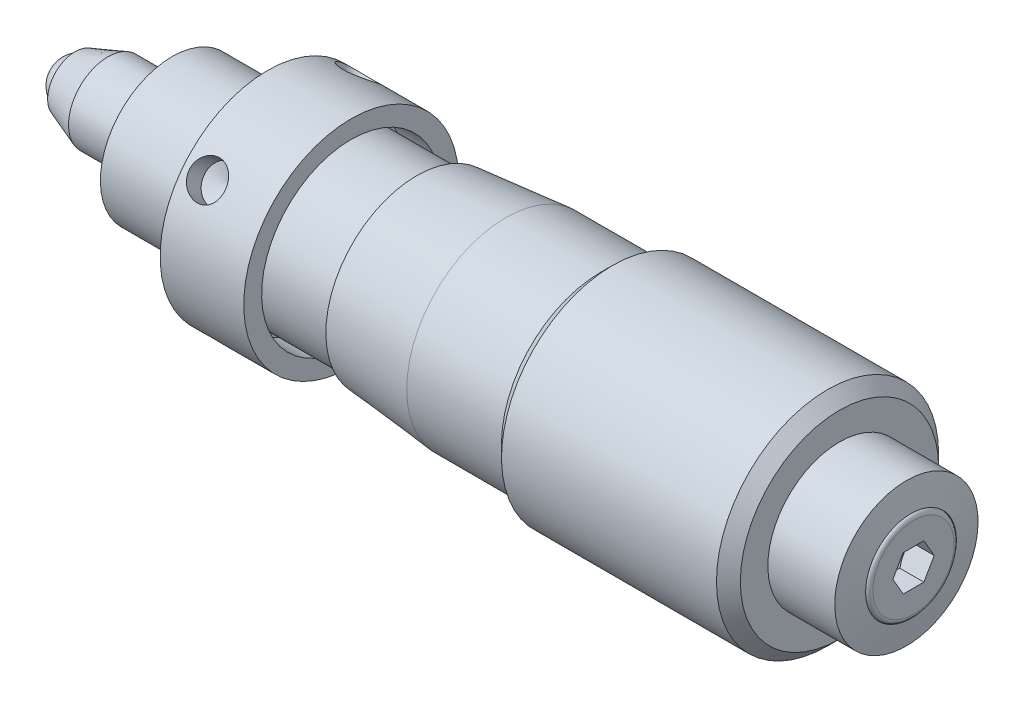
ISO-10303-21;
HEADER;
FILE_DESCRIPTION(('STEP AP214'),'2;1');
FILE_NAME('part.step','',(''),(''),'','','');
FILE_SCHEMA(('AUTOMOTIVE_DESIGN { 1 0 10303 214 1 1 1 1 }'));
ENDSEC;
DATA;
#1=APPLICATION_CONTEXT('core data for automotive mechanical design processes');
#2=APPLICATION_PROTOCOL_DEFINITION('international standard','automotive_design',2000,#1);
#3=PRODUCT_CONTEXT('',#1,'mechanical');
#4=PRODUCT('Part','Part','',(#3));
#5=PRODUCT_RELATED_PRODUCT_CATEGORY('part','',(#4));
#6=PRODUCT_DEFINITION_FORMATION('','',#4);
#7=PRODUCT_DEFINITION_CONTEXT('part definition',#1,'design');
#8=PRODUCT_DEFINITION('design','',#6,#7);
#9=PRODUCT_DEFINITION_SHAPE('','',#8);
#10=(LENGTH_UNIT() NAMED_UNIT(*) SI_UNIT(.MILLI.,.METRE.));
#11=(NAMED_UNIT(*) PLANE_ANGLE_UNIT() SI_UNIT($,.RADIAN.));
#12=(NAMED_UNIT(*) SI_UNIT($,.STERADIAN.) SOLID_ANGLE_UNIT());
#13=UNCERTAINTY_MEASURE_WITH_UNIT(LENGTH_MEASURE(1.E-05),#10,'distance_accuracy_value','');
#14=(GEOMETRIC_REPRESENTATION_CONTEXT(3) GLOBAL_UNCERTAINTY_ASSIGNED_CONTEXT((#13)) GLOBAL_UNIT_ASSIGNED_CONTEXT((#10,
#11,#12)) REPRESENTATION_CONTEXT('',''));
#15=CARTESIAN_POINT('',(0.,0.,0.));
#16=DIRECTION('',(0.,0.,1.));
#17=DIRECTION('',(1.,0.,0.));
#18=AXIS2_PLACEMENT_3D('',#15,#16,#17);
#19=CARTESIAN_POINT('',(-25.1232337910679,4.11650496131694,0.));
#20=DIRECTION('',(0.182641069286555,0.794689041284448,0.578888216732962));
#21=DIRECTION('',(-0.904363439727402,0.366777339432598,-0.218176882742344));
#22=AXIS2_PLACEMENT_3D('',#19,#20,#21);
#23=SPHERICAL_SURFACE('',#22,1.);
#24=CARTESIAN_POINT('',(-25.3152845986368,4.11650496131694,0.981384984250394));
#25=CARTESIAN_POINT('',(-25.3152845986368,4.06144587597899,0.981379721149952));
#26=CARTESIAN_POINT('',(-25.3152845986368,4.00626772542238,0.97672371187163));
#27=CARTESIAN_POINT('',(-25.3152845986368,3.92471876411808,0.96286181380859));
#28=CARTESIAN_POINT('',(-25.3152845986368,3.89769782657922,0.957080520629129));
#29=CARTESIAN_POINT('',(-25.3152845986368,3.84421283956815,0.9432582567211));
#30=CARTESIAN_POINT('',(-25.3152845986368,3.81774924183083,0.935215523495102));
#31=CARTESIAN_POINT('',(-25.3152845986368,3.73962075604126,0.907806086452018));
#32=CARTESIAN_POINT('',(-25.3152845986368,3.68907424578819,0.885133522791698));
#33=CARTESIAN_POINT('',(-25.3152845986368,3.59252833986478,0.831633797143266));
#34=CARTESIAN_POINT('',(-25.3152845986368,3.5465291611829,0.800806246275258));
#35=CARTESIAN_POINT('',(-25.3152845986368,3.4603561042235,0.731866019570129));
#36=CARTESIAN_POINT('',(-25.3152845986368,3.42018173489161,0.693753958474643));
#37=CARTESIAN_POINT('',(-25.3152845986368,3.34679864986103,0.611322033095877));
#38=CARTESIAN_POINT('',(-25.3152845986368,3.31359077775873,0.567001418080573));
#39=CARTESIAN_POINT('',(-25.3152845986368,3.2550877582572,0.473415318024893));
#40=CARTESIAN_POINT('',(-25.3152845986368,3.22979242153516,0.42414995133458));
#41=CARTESIAN_POINT('',(-25.3152845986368,3.18783419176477,0.322073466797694));
#42=CARTESIAN_POINT('',(-25.3152845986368,3.171170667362,0.269262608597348));
#43=CARTESIAN_POINT('',(-25.3152845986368,3.14694358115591,0.161597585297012));
#44=CARTESIAN_POINT('',(-25.3152845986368,3.1393804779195,0.106743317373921));
#45=CARTESIAN_POINT('',(-25.3152845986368,3.13357762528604,-0.00348240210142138));
#46=CARTESIAN_POINT('',(-25.3152845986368,3.13533761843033,-0.0588538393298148));
#47=CARTESIAN_POINT('',(-25.3152845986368,3.14491935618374,-0.141081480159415));
#48=CARTESIAN_POINT('',(-25.3152845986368,3.14927859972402,-0.168381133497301));
#49=CARTESIAN_POINT('',(-25.3152845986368,3.16027479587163,-0.222490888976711));
#50=CARTESIAN_POINT('',(-25.3152845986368,3.16690978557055,-0.249301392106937));
#51=CARTESIAN_POINT('',(-25.3152845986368,3.19016254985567,-0.328689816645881));
#52=CARTESIAN_POINT('',(-25.3152845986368,3.21014159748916,-0.380339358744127));
#53=CARTESIAN_POINT('',(-25.3152845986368,3.24620232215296,-0.45434677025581));
#54=CARTESIAN_POINT('',(-25.3152845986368,3.25913543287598,-0.478294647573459));
#55=CARTESIAN_POINT('',(-25.3152845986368,3.28692001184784,-0.525025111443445));
#56=CARTESIAN_POINT('',(-25.3152845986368,3.30177147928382,-0.547807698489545));
#57=CARTESIAN_POINT('',(-25.3152845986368,3.38153700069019,-0.659498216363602));
#58=CARTESIAN_POINT('',(-25.3152845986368,3.46138652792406,-0.738873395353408));
#59=CARTESIAN_POINT('',(-25.3152845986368,3.57390644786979,-0.818227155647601));
#60=CARTESIAN_POINT('',(-25.3152845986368,3.59715340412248,-0.833163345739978));
#61=CARTESIAN_POINT('',(-25.3152845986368,3.64481208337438,-0.86103171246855));
#62=CARTESIAN_POINT('',(-25.3152845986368,3.66922248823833,-0.873966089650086));
#63=CARTESIAN_POINT('',(-25.3152845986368,3.74388648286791,-0.909565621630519));
#64=CARTESIAN_POINT('',(-25.3152845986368,3.79567177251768,-0.929096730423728));
#65=CARTESIAN_POINT('',(-25.3152845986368,3.90180876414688,-0.959202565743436));
#66=CARTESIAN_POINT('',(-25.3152845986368,3.95616269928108,-0.969769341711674));
#67=CARTESIAN_POINT('',(-25.3152845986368,4.06588242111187,-0.981630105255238));
#68=CARTESIAN_POINT('',(-25.3152845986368,4.12124826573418,-0.982923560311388));
#69=CARTESIAN_POINT('',(-25.3152845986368,4.23140811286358,-0.976196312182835));
#70=CARTESIAN_POINT('',(-25.3152845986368,4.28620213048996,-0.968175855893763));
#71=CARTESIAN_POINT('',(-25.3152845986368,4.39366612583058,-0.943049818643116));
#72=CARTESIAN_POINT('',(-25.3152845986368,4.4463361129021,-0.925944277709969));
#73=CARTESIAN_POINT('',(-25.3152845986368,4.54805679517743,-0.883133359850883));
#74=CARTESIAN_POINT('',(-25.3152845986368,4.59710747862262,-0.857427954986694));
#75=CARTESIAN_POINT('',(-25.3152845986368,4.69019700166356,-0.79814715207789));
#76=CARTESIAN_POINT('',(-25.3152845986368,4.73423585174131,-0.764571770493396));
#77=CARTESIAN_POINT('',(-25.3152845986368,4.816051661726,-0.690504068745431));
#78=CARTESIAN_POINT('',(-25.3152845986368,4.85382862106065,-0.650011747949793));
#79=CARTESIAN_POINT('',(-25.3152845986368,4.92204834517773,-0.563259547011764));
#80=CARTESIAN_POINT('',(-25.3152845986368,4.95249109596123,-0.516999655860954));
#81=CARTESIAN_POINT('',(-25.3152845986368,5.00517812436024,-0.420025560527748));
#82=CARTESIAN_POINT('',(-25.3152845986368,5.0274224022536,-0.369311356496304));
#83=CARTESIAN_POINT('',(-25.3152845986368,5.06308100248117,-0.264868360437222));
#84=CARTESIAN_POINT('',(-25.3152845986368,5.07649534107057,-0.211139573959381));
#85=CARTESIAN_POINT('',(-25.3152845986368,5.09411334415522,-0.10219249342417));
#86=CARTESIAN_POINT('',(-25.3152845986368,5.0983170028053,-0.0469741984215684));
#87=CARTESIAN_POINT('',(-25.3152845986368,5.09739428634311,0.0633844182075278));
#88=CARTESIAN_POINT('',(-25.3152845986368,5.09226790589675,0.118524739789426));
#89=CARTESIAN_POINT('',(-25.3152845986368,5.0728307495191,0.227161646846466));
#90=CARTESIAN_POINT('',(-25.3152845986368,5.05852004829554,0.280658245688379));
#91=CARTESIAN_POINT('',(-25.3152845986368,5.02112008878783,0.384490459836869));
#92=CARTESIAN_POINT('',(-25.3152845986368,4.99803069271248,0.434826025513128));
#93=CARTESIAN_POINT('',(-25.3152845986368,4.94372807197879,0.53090858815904));
#94=CARTESIAN_POINT('',(-25.3152845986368,4.91251443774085,0.576655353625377));
#95=CARTESIAN_POINT('',(-25.3152845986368,4.84285173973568,0.662254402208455));
#96=CARTESIAN_POINT('',(-25.3152845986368,4.80440351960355,0.702107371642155));
#97=CARTESIAN_POINT('',(-25.3152845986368,4.72136618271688,0.774794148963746));
#98=CARTESIAN_POINT('',(-25.3152845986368,4.67677656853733,0.807627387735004));
#99=CARTESIAN_POINT('',(-25.3152845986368,4.58269319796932,0.865347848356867));
#100=CARTESIAN_POINT('',(-25.3152845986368,4.53319966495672,0.890235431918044));
#101=CARTESIAN_POINT('',(-25.3152845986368,4.45636082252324,0.921076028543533));
#102=CARTESIAN_POINT('',(-25.3152845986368,4.43027911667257,0.93028217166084));
#103=CARTESIAN_POINT('',(-25.3152845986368,4.37745829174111,0.94645815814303));
#104=CARTESIAN_POINT('',(-25.3152845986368,4.35071970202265,0.95342974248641));
#105=CARTESIAN_POINT('',(-25.3152845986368,4.26986420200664,0.970887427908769));
#106=CARTESIAN_POINT('',(-25.3152845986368,4.21494623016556,0.977981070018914));
#107=CARTESIAN_POINT('',(-25.3152845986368,4.14546932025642,0.981065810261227));
#108=CARTESIAN_POINT('',(-25.3152845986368,4.13099126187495,0.981386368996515));
#109=CARTESIAN_POINT('',(-25.3152845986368,4.11650496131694,0.981384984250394));
#110=B_SPLINE_CURVE_WITH_KNOTS('',3,(#24,#25,#26,#27,#28,#29,#30,#31,#32,#33,#34,#35,#36,#37,
#38,#39,#40,#41,#42,#43,#44,#45,#46,#47,#48,#49,#50,#51,#52,#53,#54,#55,#56,#57,#58,#59,#60,#61,
#62,#63,#64,#65,#66,#67,#68,#69,#70,#71,#72,#73,#74,#75,#76,#77,#78,#79,#80,#81,#82,#83,#84,#85,
#86,#87,#88,#89,#90,#91,#92,#93,#94,#95,#96,#97,#98,#99,#100,#101,#102,#103,#104,#105,#106,#107,
#108,#109),.UNSPECIFIED.,.T.,.F.,(4,2,2,2,2,2,2,2,2,2,2,2,2,2,2,2,2,2,2,2,2,2,2,2,2,2,2,2,2,2,2,
2,2,2,2,2,2,2,2,2,2,2,4),(0.,0.165132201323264,0.247955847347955,0.330844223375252,
0.496188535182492,0.66154073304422,0.826878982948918,0.992237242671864,1.15759154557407,
1.322933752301,1.48828429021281,1.65363026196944,1.73648028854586,1.81925903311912,
1.98447426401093,2.06603715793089,2.14760001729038,2.47712099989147,2.55999032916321,
2.64276790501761,2.80796505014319,2.97330855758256,3.13866155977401,3.30401017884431,
3.46935806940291,3.63470649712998,3.80005457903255,3.96540267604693,4.13075108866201,
4.2960994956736,4.46144759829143,4.62679580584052,4.79214410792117,4.95749106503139,
5.12284061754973,5.28819850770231,5.45353712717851,5.61888914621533,5.78423363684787,
5.86712206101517,5.94994574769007,6.11507786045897,6.15852490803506),.UNSPECIFIED.);
#111=CARTESIAN_POINT('',(-25.3152845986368,4.11650496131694,0.981384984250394));
#112=VERTEX_POINT('',#111);
#113=EDGE_CURVE('E593',#112,#112,#110,.T.);
#114=ORIENTED_EDGE('',*,*,#113,.F.);
#115=EDGE_LOOP('',(#114));
#116=FACE_BOUND('',#115,.T.);
#117=ADVANCED_FACE('F17',(#116),#23,.T.);
#118=CARTESIAN_POINT('',(-25.3152845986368,4.22302410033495,-0.565047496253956));
#119=DIRECTION('',(-1.,0.,0.));
#120=DIRECTION('',(0.,-1.,0.));
#121=AXIS2_PLACEMENT_3D('',#118,#119,#120);
#122=PLANE('',#121);
#123=ORIENTED_EDGE('',*,*,#113,.T.);
#124=EDGE_LOOP('',(#123));
#125=FACE_BOUND('',#124,.T.);
#126=CARTESIAN_POINT('',(-25.3152845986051,4.11650496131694,0.));
#127=DIRECTION('',(1.,0.,0.));
#128=DIRECTION('',(0.,0.,-1.));
#129=AXIS2_PLACEMENT_3D('',#126,#127,#128);
#130=CIRCLE('',#129,1.14999999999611);
#131=CARTESIAN_POINT('',(-25.3152845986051,4.11650496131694,-1.14999999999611));
#132=VERTEX_POINT('',#131);
#133=EDGE_CURVE('E254',#132,#132,#130,.T.);
#134=ORIENTED_EDGE('',*,*,#133,.F.);
#135=EDGE_LOOP('',(#134));
#136=FACE_BOUND('',#135,.T.);
#137=ADVANCED_FACE('F515',(#125,#136),#122,.T.);
#138=CARTESIAN_POINT('',(-23.9415458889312,4.11650496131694,0.));
#139=DIRECTION('',(1.,0.,0.));
#140=DIRECTION('',(0.,0.,-1.));
#141=AXIS2_PLACEMENT_3D('',#138,#139,#140);
#142=CONICAL_SURFACE('',#141,1.64999999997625,0.349065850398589);
#143=ORIENTED_EDGE('',*,*,#133,.T.);
#144=EDGE_LOOP('',(#143));
#145=FACE_BOUND('',#144,.T.);
#146=CARTESIAN_POINT('',(-23.9415458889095,4.11650496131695,0.));
#147=DIRECTION('',(1.,0.,0.));
#148=DIRECTION('',(0.,1.,0.));
#149=AXIS2_PLACEMENT_3D('',#146,#147,#148);
#150=CIRCLE('',#149,1.65);
#151=CARTESIAN_POINT('',(-23.9415458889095,5.76650496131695,0.));
#152=VERTEX_POINT('',#151);
#153=EDGE_CURVE('E240',#152,#152,#150,.T.);
#154=ORIENTED_EDGE('',*,*,#153,.F.);
#155=EDGE_LOOP('',(#154));
#156=FACE_BOUND('',#155,.T.);
#157=ADVANCED_FACE('F510',(#145,#156),#142,.T.);
#158=CARTESIAN_POINT('',(-18.4784152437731,4.11650496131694,0.));
#159=DIRECTION('',(1.,0.,0.));
#160=DIRECTION('',(0.,1.,0.));
#161=AXIS2_PLACEMENT_3D('',#158,#159,#160);
#162=CYLINDRICAL_SURFACE('',#161,1.65);
#163=ORIENTED_EDGE('',*,*,#153,.T.);
#164=EDGE_LOOP('',(#163));
#165=FACE_BOUND('',#164,.T.);
#166=CARTESIAN_POINT('',(-21.2560983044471,4.11650496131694,0.));
#167=DIRECTION('',(1.,0.,0.));
#168=DIRECTION('',(0.,1.,0.));
#169=AXIS2_PLACEMENT_3D('',#166,#167,#168);
#170=CIRCLE('',#169,1.65);
#171=CARTESIAN_POINT('',(-21.2560983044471,5.76650496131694,0.));
#172=VERTEX_POINT('',#171);
#173=EDGE_CURVE('E224',#172,#172,#170,.T.);
#174=ORIENTED_EDGE('',*,*,#173,.F.);
#175=EDGE_LOOP('',(#174));
#176=FACE_BOUND('',#175,.T.);
#177=ADVANCED_FACE('F505',(#165,#176),#162,.T.);
#178=CARTESIAN_POINT('',(-16.2560983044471,1.21443480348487,2.29520996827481));
#179=DIRECTION('',(0.,-0.784343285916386,0.620327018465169));
#180=DIRECTION('',(0.,-0.620327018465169,-0.784343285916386));
#181=AXIS2_PLACEMENT_3D('',#178,#179,#180);
#182=CONICAL_SURFACE('',#181,0.749999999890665,1.02974425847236);
#183=DIRECTION('',(0.,0.93569069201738,0.35282138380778));
#184=VECTOR('',#183,1.);
#185=CARTESIAN_POINT('',(-16.2560983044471,-499000.,-188156.769296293));
#186=LINE('',#185,#184);
#187=CARTESIAN_POINT('',(-16.2560983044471,0.749189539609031,1.7069525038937));
#188=VERTEX_POINT('',#187);
#189=CARTESIAN_POINT('',(-16.2560983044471,1.56789554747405,2.01566241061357));
#190=VERTEX_POINT('',#189);
#191=EDGE_CURVE('E237',#188,#190,#186,.T.);
#192=ORIENTED_EDGE('',*,*,#191,.F.);
#193=CARTESIAN_POINT('',(-16.2560983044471,1.21443480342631,2.29520996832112));
#194=DIRECTION('',(0.,0.784343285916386,-0.620327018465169));
#195=DIRECTION('',(0.,0.620327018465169,0.784343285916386));
#196=AXIS2_PLACEMENT_3D('',#193,#194,#195);
#197=CIRCLE('',#196,0.75);
#198=CARTESIAN_POINT('',(-16.2560983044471,1.67968006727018,2.88346743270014));
#199=VERTEX_POINT('',#198);
#200=EDGE_CURVE('E220',#188,#199,#197,.F.);
#201=ORIENTED_EDGE('',*,*,#200,.T.);
#202=DIRECTION('',(0.,-0.127757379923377,-0.991805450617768));
#203=VECTOR('',#202,1.);
#204=CARTESIAN_POINT('',(-16.2560983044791,68134.2675535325,528929.447695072));
#205=LINE('',#204,#203);
#206=EDGE_CURVE('E239',#190,#199,#205,.F.);
#207=ORIENTED_EDGE('',*,*,#206,.F.);
#208=EDGE_LOOP('',(#192,#201,#207));
#209=FACE_BOUND('',#208,.T.);
#210=ADVANCED_FACE('F500',(#209),#182,.F.);
#211=CARTESIAN_POINT('',(-16.2560983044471,1.82129499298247,-2.9020701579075));
#212=DIRECTION('',(0.,-0.620327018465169,-0.784343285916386));
#213=DIRECTION('',(0.,0.784343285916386,-0.620327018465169));
#214=AXIS2_PLACEMENT_3D('',#211,#212,#213);
#215=CONICAL_SURFACE('',#214,0.750000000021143,1.02974425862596);
#216=CARTESIAN_POINT('',(-16.2560983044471,1.82129499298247,-2.9020701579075));
#217=DIRECTION('',(0.,-0.620327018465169,-0.784343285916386));
#218=DIRECTION('',(0.,0.784343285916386,-0.620327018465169));
#219=AXIS2_PLACEMENT_3D('',#216,#217,#218);
#220=CIRCLE('',#219,0.750000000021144);
#221=CARTESIAN_POINT('',(-16.2560983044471,2.4095524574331,-3.36731542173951));
#222=VERTEX_POINT('',#221);
#223=CARTESIAN_POINT('',(-16.2560983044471,1.23303752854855,-2.436824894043));
#224=VERTEX_POINT('',#223);
#225=EDGE_CURVE('E244',#222,#224,#220,.F.);
#226=ORIENTED_EDGE('',*,*,#225,.F.);
#227=DIRECTION('',(0.,-0.352821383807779,0.93569069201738));
#228=VECTOR('',#227,1.);
#229=CARTESIAN_POINT('',(-16.2560983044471,188159.333588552,-499000.));
#230=LINE('',#229,#228);
#231=CARTESIAN_POINT('',(-16.2560983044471,2.10084255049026,-2.54860941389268));
#232=VERTEX_POINT('',#231);
#233=EDGE_CURVE('E223',#222,#232,#230,.T.);
#234=ORIENTED_EDGE('',*,*,#233,.T.);
#235=DIRECTION('',(0.,0.991805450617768,-0.127757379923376));
#236=VECTOR('',#235,1.);
#237=CARTESIAN_POINT('',(-16.2560983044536,-528920.967812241,68129.588989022));
#238=LINE('',#237,#236);
#239=EDGE_CURVE('E260',#232,#224,#238,.F.);
#240=ORIENTED_EDGE('',*,*,#239,.T.);
#241=EDGE_LOOP('',(#226,#234,#240));
#242=FACE_BOUND('',#241,.T.);
#243=ADVANCED_FACE('F495',(#242),#215,.F.);
#244=CARTESIAN_POINT('',(-21.2560983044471,6.32548728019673,-0.725273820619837));
#245=DIRECTION('',(-1.,0.,0.));
#246=DIRECTION('',(0.,-1.,0.));
#247=AXIS2_PLACEMENT_3D('',#244,#245,#246);
#248=PLANE('',#247);
#249=ORIENTED_EDGE('',*,*,#173,.T.);
#250=EDGE_LOOP('',(#249));
#251=FACE_BOUND('',#250,.T.);
#252=CARTESIAN_POINT('',(-21.2560983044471,4.11650496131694,0.));
#253=DIRECTION('',(1.,0.,0.));
#254=DIRECTION('',(0.,1.,0.));
#255=AXIS2_PLACEMENT_3D('',#252,#253,#254);
#256=CIRCLE('',#255,3.);
#257=CARTESIAN_POINT('',(-21.2560983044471,7.11650496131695,0.));
#258=VERTEX_POINT('',#257);
#259=EDGE_CURVE('E236',#258,#258,#256,.T.);
#260=ORIENTED_EDGE('',*,*,#259,.F.);
#261=EDGE_LOOP('',(#260));
#262=FACE_BOUND('',#261,.T.);
#263=ADVANCED_FACE('F490',(#251,#262),#248,.T.);
#264=CARTESIAN_POINT('',(-16.2560983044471,7.01857511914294,-2.29520996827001));
#265=DIRECTION('',(0.,0.784343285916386,-0.620327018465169));
#266=DIRECTION('',(0.,0.620327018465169,0.784343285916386));
#267=AXIS2_PLACEMENT_3D('',#264,#265,#266);
#268=CONICAL_SURFACE('',#267,0.749999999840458,1.02974425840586);
#269=CARTESIAN_POINT('',(-16.2560983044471,6.66511437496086,-2.01566241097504));
#270=VERTEX_POINT('',#269);
#271=VERTEX_LOOP('',#270);
#272=FACE_BOUND('',#271,.T.);
#273=CARTESIAN_POINT('',(-16.2560983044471,7.01857511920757,-2.29520996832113));
#274=DIRECTION('',(0.,0.784343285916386,-0.620327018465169));
#275=DIRECTION('',(0.,0.620327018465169,0.784343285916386));
#276=AXIS2_PLACEMENT_3D('',#273,#274,#275);
#277=CIRCLE('',#276,0.75);
#278=CARTESIAN_POINT('',(-16.2560983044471,7.48382038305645,-1.70695250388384));
#279=VERTEX_POINT('',#278);
#280=EDGE_CURVE('E231',#279,#279,#277,.T.);
#281=ORIENTED_EDGE('',*,*,#280,.T.);
#282=EDGE_LOOP('',(#281));
#283=FACE_BOUND('',#282,.T.);
#284=ADVANCED_FACE('F485',(#272,#283),#268,.F.);
#285=CARTESIAN_POINT('',(-16.2560983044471,1.21443480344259,2.29520996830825));
#286=DIRECTION('',(0.,-0.784343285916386,0.620327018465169));
#287=DIRECTION('',(0.,-0.620327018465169,-0.784343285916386));
#288=AXIS2_PLACEMENT_3D('',#285,#286,#287);
#289=CONICAL_SURFACE('',#288,0.750000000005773,1.0297442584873);
#290=CARTESIAN_POINT('',(-16.2560983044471,1.21443480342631,2.29520996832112));
#291=DIRECTION('',(0.,0.784343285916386,-0.620327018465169));
#292=DIRECTION('',(0.,0.620327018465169,0.784343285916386));
#293=AXIS2_PLACEMENT_3D('',#290,#291,#292);
#294=CIRCLE('',#293,0.75);
#295=EDGE_CURVE('E227',#199,#188,#294,.F.);
#296=ORIENTED_EDGE('',*,*,#295,.T.);
#297=ORIENTED_EDGE('',*,*,#191,.T.);
#298=ORIENTED_EDGE('',*,*,#206,.T.);
#299=EDGE_LOOP('',(#296,#297,#298));
#300=FACE_BOUND('',#299,.T.);
#301=ADVANCED_FACE('F480',(#300),#289,.F.);
#302=CARTESIAN_POINT('',(-16.2560983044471,1.82129499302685,-2.90207015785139));
#303=DIRECTION('',(0.,-0.620327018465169,-0.784343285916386));
#304=DIRECTION('',(0.,0.784343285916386,-0.620327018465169));
#305=AXIS2_PLACEMENT_3D('',#302,#303,#304);
#306=CONICAL_SURFACE('',#305,0.749999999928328,1.02974425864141);
#307=ORIENTED_EDGE('',*,*,#233,.F.);
#308=CARTESIAN_POINT('',(-16.2560983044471,1.82129499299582,-2.90207015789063));
#309=DIRECTION('',(0.,0.620327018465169,0.784343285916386));
#310=DIRECTION('',(0.,-0.784343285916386,0.620327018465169));
#311=AXIS2_PLACEMENT_3D('',#308,#309,#310);
#312=CIRCLE('',#311,0.75);
#313=EDGE_CURVE('E230',#222,#224,#312,.F.);
#314=ORIENTED_EDGE('',*,*,#313,.T.);
#315=ORIENTED_EDGE('',*,*,#239,.F.);
#316=EDGE_LOOP('',(#307,#314,#315));
#317=FACE_BOUND('',#316,.T.);
#318=ADVANCED_FACE('F475',(#317),#306,.F.);
#319=CARTESIAN_POINT('',(-18.7560983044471,4.11650496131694,0.));
#320=DIRECTION('',(1.,0.,0.));
#321=DIRECTION('',(0.,1.,0.));
#322=AXIS2_PLACEMENT_3D('',#319,#320,#321);
#323=CYLINDRICAL_SURFACE('',#322,3.);
#324=ORIENTED_EDGE('',*,*,#259,.T.);
#325=EDGE_LOOP('',(#324));
#326=FACE_BOUND('',#325,.T.);
#327=CARTESIAN_POINT('',(-17.2560983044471,4.11650496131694,0.));
#328=DIRECTION('',(1.,0.,0.));
#329=DIRECTION('',(0.,1.,0.));
#330=AXIS2_PLACEMENT_3D('',#327,#328,#329);
#331=CIRCLE('',#330,3.);
#332=CARTESIAN_POINT('',(-17.2560983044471,7.11650496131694,0.));
#333=VERTEX_POINT('',#332);
#334=EDGE_CURVE('E251',#333,#333,#331,.T.);
#335=ORIENTED_EDGE('',*,*,#334,.F.);
#336=EDGE_LOOP('',(#335));
#337=FACE_BOUND('',#336,.T.);
#338=ADVANCED_FACE('F470',(#326,#337),#323,.T.);
#339=CARTESIAN_POINT('',(-16.2560983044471,6.41171492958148,2.90207015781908));
#340=DIRECTION('',(0.,0.620327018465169,0.784343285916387));
#341=DIRECTION('',(0.,-0.784343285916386,0.620327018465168));
#342=AXIS2_PLACEMENT_3D('',#339,#340,#341);
#343=CONICAL_SURFACE('',#342,0.749999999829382,1.02974425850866);
#344=CARTESIAN_POINT('',(-16.2560983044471,6.13216737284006,2.54860941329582));
#345=VERTEX_POINT('',#344);
#346=VERTEX_LOOP('',#345);
#347=FACE_BOUND('',#346,.T.);
#348=CARTESIAN_POINT('',(-16.2560983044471,6.41171492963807,2.90207015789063));
#349=DIRECTION('',(0.,0.620327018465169,0.784343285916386));
#350=DIRECTION('',(0.,-0.784343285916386,0.620327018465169));
#351=AXIS2_PLACEMENT_3D('',#348,#349,#350);
#352=CIRCLE('',#351,0.75);
#353=CARTESIAN_POINT('',(-16.2560983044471,5.82345746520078,3.3673154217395));
#354=VERTEX_POINT('',#353);
#355=EDGE_CURVE('E247',#354,#354,#352,.T.);
#356=ORIENTED_EDGE('',*,*,#355,.T.);
#357=EDGE_LOOP('',(#356));
#358=FACE_BOUND('',#357,.T.);
#359=ADVANCED_FACE('F465',(#347,#358),#343,.F.);
#360=CARTESIAN_POINT('',(-16.2560983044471,7.33231243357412,-2.54334077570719));
#361=DIRECTION('',(0.,0.784343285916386,-0.620327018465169));
#362=DIRECTION('',(0.,0.620327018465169,0.784343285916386));
#363=AXIS2_PLACEMENT_3D('',#360,#361,#362);
#364=CYLINDRICAL_SURFACE('',#363,0.75);
#365=ORIENTED_EDGE('',*,*,#280,.F.);
#366=EDGE_LOOP('',(#365));
#367=FACE_BOUND('',#366,.T.);
#368=CARTESIAN_POINT('',(-16.2560983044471,7.13143779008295,-3.34068556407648));
#369=CARTESIAN_POINT('',(-16.2142901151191,7.13143955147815,-3.3406846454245));
#370=CARTESIAN_POINT('',(-16.1724558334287,7.134082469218,-3.33830462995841));
#371=CARTESIAN_POINT('',(-16.0899573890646,7.14454161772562,-3.32881989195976));
#372=CARTESIAN_POINT('',(-16.0492945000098,7.15236327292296,-3.32171021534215));
#373=CARTESIAN_POINT('',(-15.9703495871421,7.17282150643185,-3.30289584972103));
#374=CARTESIAN_POINT('',(-15.9320655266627,7.18545389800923,-3.29119515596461));
#375=CARTESIAN_POINT('',(-15.8589019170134,7.21498981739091,-3.26340326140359));
#376=CARTESIAN_POINT('',(-15.8240217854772,7.23189261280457,-3.24731281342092));
#377=CARTESIAN_POINT('',(-15.7583080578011,7.26945063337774,-3.21086009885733));
#378=CARTESIAN_POINT('',(-15.7275125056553,7.29013737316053,-3.19046171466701));
#379=CARTESIAN_POINT('',(-15.6711658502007,7.33436558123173,-3.14584768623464));
#380=CARTESIAN_POINT('',(-15.6456161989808,7.35790783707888,-3.1216309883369));
#381=CARTESIAN_POINT('',(-15.6003419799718,7.40712863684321,-3.06970401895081));
#382=CARTESIAN_POINT('',(-15.5806557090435,7.43281987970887,-3.04197239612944));
#383=CARTESIAN_POINT('',(-15.5479275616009,7.48527100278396,-2.98378005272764));
#384=CARTESIAN_POINT('',(-15.5348782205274,7.51202964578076,-2.95332244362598));
#385=CARTESIAN_POINT('',(-15.5189525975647,7.55682178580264,-2.90086011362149));
#386=CARTESIAN_POINT('',(-15.514139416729,7.57481559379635,-2.87938925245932));
#387=CARTESIAN_POINT('',(-15.5077116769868,7.61062448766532,-2.83582858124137));
#388=CARTESIAN_POINT('',(-15.5060970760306,7.62843957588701,-2.81373877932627));
#389=CARTESIAN_POINT('',(-15.5061001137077,7.67198671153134,-2.75867556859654));
#390=CARTESIAN_POINT('',(-15.5096070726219,7.69747915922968,-2.72549474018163));
#391=CARTESIAN_POINT('',(-15.5235376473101,7.74686500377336,-2.65935980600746));
#392=CARTESIAN_POINT('',(-15.533968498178,7.77075669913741,-2.62640597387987));
#393=CARTESIAN_POINT('',(-15.561423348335,7.81633993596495,-2.56179300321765));
#394=CARTESIAN_POINT('',(-15.5784417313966,7.83803333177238,-2.53013278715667));
#395=CARTESIAN_POINT('',(-15.6185733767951,7.87881003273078,-2.46909085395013));
#396=CARTESIAN_POINT('',(-15.6416855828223,7.89789378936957,-2.43970874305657));
#397=CARTESIAN_POINT('',(-15.6935819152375,7.93330303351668,-2.38393675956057));
#398=CARTESIAN_POINT('',(-15.7224124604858,7.9496037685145,-2.35757436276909));
#399=CARTESIAN_POINT('',(-15.7848356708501,7.97904016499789,-2.30903223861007));
#400=CARTESIAN_POINT('',(-15.8184296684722,7.99217493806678,-2.28685368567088));
#401=CARTESIAN_POINT('',(-15.8896875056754,8.01521086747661,-2.24735844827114));
#402=CARTESIAN_POINT('',(-15.927376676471,8.02509017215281,-2.2300747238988));
#403=CARTESIAN_POINT('',(-16.0055586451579,8.04139730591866,-2.20124893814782));
#404=CARTESIAN_POINT('',(-16.04604822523,8.04782902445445,-2.18970040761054));
#405=CARTESIAN_POINT('',(-16.114978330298,8.05564971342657,-2.17558687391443));
#406=CARTESIAN_POINT('',(-16.1429751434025,8.0580029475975,-2.17131396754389));
#407=CARTESIAN_POINT('',(-16.1993434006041,8.06114240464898,-2.16560521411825));
#408=CARTESIAN_POINT('',(-16.2277148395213,8.06192864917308,-2.16416932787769));
#409=CARTESIAN_POINT('',(-16.297906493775,8.06192782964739,-2.16417256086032));
#410=CARTESIAN_POINT('',(-16.3397407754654,8.06022073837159,-2.16729270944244));
#411=CARTESIAN_POINT('',(-16.4222392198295,8.0534008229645,-2.17965567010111));
#412=CARTESIAN_POINT('',(-16.4629021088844,8.04828442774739,-2.18890490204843));
#413=CARTESIAN_POINT('',(-16.541847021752,8.03468954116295,-2.21314740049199));
#414=CARTESIAN_POINT('',(-16.5801310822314,8.02621397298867,-2.22813567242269));
#415=CARTESIAN_POINT('',(-16.6532946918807,8.00597446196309,-2.26327997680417));
#416=CARTESIAN_POINT('',(-16.6881748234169,7.99421108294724,-2.28343512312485));
#417=CARTESIAN_POINT('',(-16.753888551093,7.96739194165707,-2.32838107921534));
#418=CARTESIAN_POINT('',(-16.7846841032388,7.95230829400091,-2.3532108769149));
#419=CARTESIAN_POINT('',(-16.8410307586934,7.91908412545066,-2.40652785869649));
#420=CARTESIAN_POINT('',(-16.8665804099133,7.90094276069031,-2.43501605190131));
#421=CARTESIAN_POINT('',(-16.9118546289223,7.86175261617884,-2.49487613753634));
#422=CARTESIAN_POINT('',(-16.9315408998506,7.84068598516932,-2.52626530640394));
#423=CARTESIAN_POINT('',(-16.9642690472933,7.79614324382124,-2.59071228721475));
#424=CARTESIAN_POINT('',(-16.9773183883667,7.7726698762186,-2.62376817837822));
#425=CARTESIAN_POINT('',(-16.9932440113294,7.73193845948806,-2.67944208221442));
#426=CARTESIAN_POINT('',(-16.9980571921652,7.71519076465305,-2.70189847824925));
#427=CARTESIAN_POINT('',(-17.0044849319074,7.68105190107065,-2.74677995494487));
#428=CARTESIAN_POINT('',(-17.0060995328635,7.66366074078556,-2.76920503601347));
#429=CARTESIAN_POINT('',(-17.0060964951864,7.62011157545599,-2.82426664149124));
#430=CARTESIAN_POINT('',(-17.0025895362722,7.59369652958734,-2.85671779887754));
#431=CARTESIAN_POINT('',(-16.988658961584,7.54071865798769,-2.92001184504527));
#432=CARTESIAN_POINT('',(-16.9782281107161,7.51415570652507,-2.95085301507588));
#433=CARTESIAN_POINT('',(-16.9507732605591,7.46178277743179,-3.01009610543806));
#434=CARTESIAN_POINT('',(-16.9337548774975,7.4359721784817,-3.03850007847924));
#435=CARTESIAN_POINT('',(-16.893623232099,7.3859668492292,-3.09224320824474));
#436=CARTESIAN_POINT('',(-16.8705110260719,7.36177183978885,-3.11758289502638));
#437=CARTESIAN_POINT('',(-16.8186146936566,7.31565808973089,-3.16488882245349));
#438=CARTESIAN_POINT('',(-16.7897841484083,7.2937603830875,-3.18682464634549));
#439=CARTESIAN_POINT('',(-16.727360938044,7.25330592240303,-3.22665272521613));
#440=CARTESIAN_POINT('',(-16.6937669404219,7.23475010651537,-3.24454384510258));
#441=CARTESIAN_POINT('',(-16.6225091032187,7.20162456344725,-3.27605933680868));
#442=CARTESIAN_POINT('',(-16.5848199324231,7.18708187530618,-3.28965485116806));
#443=CARTESIAN_POINT('',(-16.5066379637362,7.16278852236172,-3.31216443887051));
#444=CARTESIAN_POINT('',(-16.4661483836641,7.15303245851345,-3.32108378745));
#445=CARTESIAN_POINT('',(-16.3972182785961,7.14110039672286,-3.33194568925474));
#446=CARTESIAN_POINT('',(-16.3692214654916,7.13748459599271,-3.33522004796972));
#447=CARTESIAN_POINT('',(-16.3128532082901,7.13265271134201,-3.33959028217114));
#448=CARTESIAN_POINT('',(-16.2844817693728,7.1314365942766,-3.34068618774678));
#449=CARTESIAN_POINT('',(-16.2560983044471,7.13143779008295,-3.34068556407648));
#450=B_SPLINE_CURVE_WITH_KNOTS('',3,(#368,#369,#370,#371,#372,#373,#374,#375,#376,#377,#378,
#379,#380,#381,#382,#383,#384,#385,#386,#387,#388,#389,#390,#391,#392,#393,#394,#395,#396,#397,
#398,#399,#400,#401,#402,#403,#404,#405,#406,#407,#408,#409,#410,#411,#412,#413,#414,#415,#416,
#417,#418,#419,#420,#421,#422,#423,#424,#425,#426,#427,#428,#429,#430,#431,#432,#433,#434,#435,
#436,#437,#438,#439,#440,#441,#442,#443,#444,#445,#446,#447,#448,#449),.UNSPECIFIED.,.T.,.F.,(4,
2,2,2,2,2,2,2,2,2,2,2,2,2,2,2,2,2,2,2,2,2,2,2,2,2,2,2,2,2,2,2,2,2,2,2,2,2,2,2,4),(0.,
0.125320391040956,0.250772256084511,0.376115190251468,0.501436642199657,0.627853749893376,
0.754305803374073,0.881566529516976,1.00868380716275,1.09378178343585,1.1788786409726,
1.3042126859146,1.42967790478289,1.55503639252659,1.68037316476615,1.80677238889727,
1.93320704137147,2.06047384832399,2.18759677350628,2.27267761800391,2.35775728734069,
2.48307767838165,2.6085295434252,2.73387247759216,2.85919392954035,2.98561103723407,
3.11206309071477,3.23932381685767,3.36644109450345,3.45153907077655,3.5366359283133,
3.6619699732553,3.78743519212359,3.91279367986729,4.03813045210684,4.16452967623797,
4.29096432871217,4.41823113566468,4.54535406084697,4.6304349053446,4.71551457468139),.UNSPECIFIED.);
#451=CARTESIAN_POINT('',(-16.2560983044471,7.13143779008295,-3.34068556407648));
#452=VERTEX_POINT('',#451);
#453=EDGE_CURVE('E250',#452,#452,#450,.T.);
#454=ORIENTED_EDGE('',*,*,#453,.F.);
#455=EDGE_LOOP('',(#454));
#456=FACE_BOUND('',#455,.T.);
#457=ADVANCED_FACE('F460',(#367,#456),#364,.F.);
#458=CARTESIAN_POINT('',(-16.2560983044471,0.900697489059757,2.54334077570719));
#459=DIRECTION('',(0.,0.784343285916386,-0.620327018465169));
#460=DIRECTION('',(0.,0.620327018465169,0.784343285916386));
#461=AXIS2_PLACEMENT_3D('',#458,#459,#460);
#462=CYLINDRICAL_SURFACE('',#461,0.75);
#463=ORIENTED_EDGE('',*,*,#200,.F.);
#464=ORIENTED_EDGE('',*,*,#295,.F.);
#465=EDGE_LOOP('',(#463,#464));
#466=FACE_BOUND('',#465,.T.);
#467=CARTESIAN_POINT('',(-16.2560983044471,0.171081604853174,2.1641706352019));
#468=CARTESIAN_POINT('',(-16.297906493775,0.171082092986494,2.16417256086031));
#469=CARTESIAN_POINT('',(-16.3397407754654,0.172789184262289,2.16729270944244));
#470=CARTESIAN_POINT('',(-16.4222392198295,0.179609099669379,2.17965567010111));
#471=CARTESIAN_POINT('',(-16.4629021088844,0.184725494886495,2.18890490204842));
#472=CARTESIAN_POINT('',(-16.541847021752,0.198320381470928,2.21314740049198));
#473=CARTESIAN_POINT('',(-16.5801310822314,0.206795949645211,2.22813567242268));
#474=CARTESIAN_POINT('',(-16.6532946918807,0.227035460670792,2.26327997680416));
#475=CARTESIAN_POINT('',(-16.6881748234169,0.238798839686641,2.28343512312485));
#476=CARTESIAN_POINT('',(-16.753888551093,0.265617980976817,2.32838107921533));
#477=CARTESIAN_POINT('',(-16.7846841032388,0.28070162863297,2.3532108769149));
#478=CARTESIAN_POINT('',(-16.8410307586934,0.313925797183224,2.40652785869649));
#479=CARTESIAN_POINT('',(-16.8665804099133,0.332067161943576,2.43501605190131));
#480=CARTESIAN_POINT('',(-16.9118546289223,0.371257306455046,2.49487613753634));
#481=CARTESIAN_POINT('',(-16.9315408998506,0.39232393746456,2.52626530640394));
#482=CARTESIAN_POINT('',(-16.9642690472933,0.436866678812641,2.59071228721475));
#483=CARTESIAN_POINT('',(-16.9773183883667,0.460340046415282,2.62376817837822));
#484=CARTESIAN_POINT('',(-16.9932440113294,0.501071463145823,2.67944208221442));
#485=CARTESIAN_POINT('',(-16.9980571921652,0.517819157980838,2.70189847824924));
#486=CARTESIAN_POINT('',(-17.0044849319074,0.551958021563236,2.74677995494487));
#487=CARTESIAN_POINT('',(-17.0060995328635,0.569349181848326,2.76920503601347));
#488=CARTESIAN_POINT('',(-17.0060964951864,0.612898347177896,2.82426664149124));
#489=CARTESIAN_POINT('',(-17.0025895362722,0.63931339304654,2.85671779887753));
#490=CARTESIAN_POINT('',(-16.988658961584,0.692291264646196,2.92001184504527));
#491=CARTESIAN_POINT('',(-16.9782281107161,0.718854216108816,2.95085301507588));
#492=CARTESIAN_POINT('',(-16.9507732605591,0.771227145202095,3.01009610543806));
#493=CARTESIAN_POINT('',(-16.9337548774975,0.797037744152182,3.03850007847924));
#494=CARTESIAN_POINT('',(-16.893623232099,0.847043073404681,3.09224320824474));
#495=CARTESIAN_POINT('',(-16.8705110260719,0.871238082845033,3.11758289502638));
#496=CARTESIAN_POINT('',(-16.8186146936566,0.917351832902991,3.16488882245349));
#497=CARTESIAN_POINT('',(-16.7897841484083,0.939249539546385,3.18682464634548));
#498=CARTESIAN_POINT('',(-16.727360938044,0.979704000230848,3.22665272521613));
#499=CARTESIAN_POINT('',(-16.6937669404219,0.998259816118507,3.24454384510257));
#500=CARTESIAN_POINT('',(-16.6225091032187,1.03138535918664,3.27605933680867));
#501=CARTESIAN_POINT('',(-16.5848199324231,1.04592804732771,3.28965485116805));
#502=CARTESIAN_POINT('',(-16.5066379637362,1.07022140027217,3.31216443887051));
#503=CARTESIAN_POINT('',(-16.4661483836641,1.07997746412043,3.32108378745));
#504=CARTESIAN_POINT('',(-16.3972182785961,1.09190952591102,3.33194568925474));
#505=CARTESIAN_POINT('',(-16.3692214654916,1.09552532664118,3.33522004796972));
#506=CARTESIAN_POINT('',(-16.3128532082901,1.10035721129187,3.33959028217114));
#507=CARTESIAN_POINT('',(-16.2844817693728,1.10157332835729,3.34068618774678));
#508=CARTESIAN_POINT('',(-16.2142901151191,1.10157037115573,3.3406846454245));
#509=CARTESIAN_POINT('',(-16.1724558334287,1.09892745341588,3.33830462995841));
#510=CARTESIAN_POINT('',(-16.0899573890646,1.08846830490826,3.32881989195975));
#511=CARTESIAN_POINT('',(-16.0492945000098,1.08064664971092,3.32171021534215));
#512=CARTESIAN_POINT('',(-15.9703495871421,1.06018841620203,3.30289584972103));
#513=CARTESIAN_POINT('',(-15.9320655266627,1.04755602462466,3.29119515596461));
#514=CARTESIAN_POINT('',(-15.8589019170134,1.01802010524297,3.26340326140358));
#515=CARTESIAN_POINT('',(-15.8240217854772,1.00111730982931,3.24731281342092));
#516=CARTESIAN_POINT('',(-15.7583080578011,0.963559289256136,3.21086009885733));
#517=CARTESIAN_POINT('',(-15.7275125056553,0.942872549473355,3.19046171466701));
#518=CARTESIAN_POINT('',(-15.6711658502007,0.898644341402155,3.14584768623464));
#519=CARTESIAN_POINT('',(-15.6456161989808,0.875102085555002,3.1216309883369));
#520=CARTESIAN_POINT('',(-15.6003419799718,0.825881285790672,3.06970401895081));
#521=CARTESIAN_POINT('',(-15.5806557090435,0.800190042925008,3.04197239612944));
#522=CARTESIAN_POINT('',(-15.5479275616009,0.747738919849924,2.98378005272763));
#523=CARTESIAN_POINT('',(-15.5348782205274,0.720980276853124,2.95332244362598));
#524=CARTESIAN_POINT('',(-15.5189525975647,0.676188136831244,2.90086011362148));
#525=CARTESIAN_POINT('',(-15.514139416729,0.658194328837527,2.87938925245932));
#526=CARTESIAN_POINT('',(-15.5077116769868,0.622385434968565,2.83582858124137));
#527=CARTESIAN_POINT('',(-15.5060970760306,0.604570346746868,2.81373877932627));
#528=CARTESIAN_POINT('',(-15.5061001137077,0.561023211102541,2.75867556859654));
#529=CARTESIAN_POINT('',(-15.5096070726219,0.535530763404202,2.72549474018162));
#530=CARTESIAN_POINT('',(-15.5235376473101,0.486144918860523,2.65935980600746));
#531=CARTESIAN_POINT('',(-15.533968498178,0.462253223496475,2.62640597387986));
#532=CARTESIAN_POINT('',(-15.561423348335,0.416669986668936,2.56179300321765));
#533=CARTESIAN_POINT('',(-15.5784417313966,0.394976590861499,2.53013278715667));
#534=CARTESIAN_POINT('',(-15.6185733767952,0.354199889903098,2.46909085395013));
#535=CARTESIAN_POINT('',(-15.6416855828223,0.335116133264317,2.43970874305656));
#536=CARTESIAN_POINT('',(-15.6935819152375,0.299706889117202,2.38393675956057));
#537=CARTESIAN_POINT('',(-15.7224124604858,0.283406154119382,2.35757436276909));
#538=CARTESIAN_POINT('',(-15.7848356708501,0.253969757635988,2.30903223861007));
#539=CARTESIAN_POINT('',(-15.8184296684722,0.240834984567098,2.28685368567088));
#540=CARTESIAN_POINT('',(-15.8896875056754,0.217799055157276,2.24735844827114));
#541=CARTESIAN_POINT('',(-15.927376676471,0.207919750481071,2.23007472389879));
#542=CARTESIAN_POINT('',(-16.0055586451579,0.191612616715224,2.20124893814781));
#543=CARTESIAN_POINT('',(-16.04604822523,0.185180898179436,2.18970040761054));
#544=CARTESIAN_POINT('',(-16.114978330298,0.177360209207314,2.17558687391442));
#545=CARTESIAN_POINT('',(-16.1429751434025,0.175006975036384,2.17131396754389));
#546=CARTESIAN_POINT('',(-16.1993434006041,0.171867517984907,2.16560521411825));
#547=CARTESIAN_POINT('',(-16.2277148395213,0.171081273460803,2.16416932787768));
#548=CARTESIAN_POINT('',(-16.2560983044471,0.171081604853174,2.1641706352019));
#549=B_SPLINE_CURVE_WITH_KNOTS('',3,(#467,#468,#469,#470,#471,#472,#473,#474,#475,#476,#477,
#478,#479,#480,#481,#482,#483,#484,#485,#486,#487,#488,#489,#490,#491,#492,#493,#494,#495,#496,
#497,#498,#499,#500,#501,#502,#503,#504,#505,#506,#507,#508,#509,#510,#511,#512,#513,#514,#515,
#516,#517,#518,#519,#520,#521,#522,#523,#524,#525,#526,#527,#528,#529,#530,#531,#532,#533,#534,
#535,#536,#537,#538,#539,#540,#541,#542,#543,#544,#545,#546,#547,#548),.UNSPECIFIED.,.T.,.F.,(4,
2,2,2,2,2,2,2,2,2,2,2,2,2,2,2,2,2,2,2,2,2,2,2,2,2,2,2,2,2,2,2,2,2,2,2,2,2,2,2,4),(0.,
0.125320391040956,0.250772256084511,0.376115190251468,0.501436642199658,0.627853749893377,
0.754305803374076,0.881566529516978,1.00868380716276,1.09378178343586,1.1788786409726,
1.3042126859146,1.42967790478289,1.5550363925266,1.68037316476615,1.80677238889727,
1.93320704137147,2.06047384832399,2.18759677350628,2.27267761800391,2.35775728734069,
2.48307767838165,2.6085295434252,2.73387247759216,2.85919392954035,2.98561103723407,
3.11206309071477,3.23932381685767,3.36644109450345,3.45153907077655,3.5366359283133,
3.6619699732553,3.78743519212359,3.91279367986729,4.03813045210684,4.16452967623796,
4.29096432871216,4.41823113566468,4.54535406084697,4.6304349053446,4.71551457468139),.UNSPECIFIED.);
#550=CARTESIAN_POINT('',(-16.2560983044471,0.171081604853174,2.1641706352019));
#551=VERTEX_POINT('',#550);
#552=EDGE_CURVE('E659',#551,#551,#549,.T.);
#553=ORIENTED_EDGE('',*,*,#552,.F.);
#554=EDGE_LOOP('',(#553));
#555=FACE_BOUND('',#554,.T.);
#556=ADVANCED_FACE('F455',(#466,#555),#462,.F.);
#557=CARTESIAN_POINT('',(-16.2560983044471,1.57316418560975,-3.21580747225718));
#558=DIRECTION('',(0.,0.620327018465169,0.784343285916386));
#559=DIRECTION('',(0.,-0.784343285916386,0.620327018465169));
#560=AXIS2_PLACEMENT_3D('',#557,#558,#559);
#561=CYLINDRICAL_SURFACE('',#560,0.75);
#562=ORIENTED_EDGE('',*,*,#225,.T.);
#563=ORIENTED_EDGE('',*,*,#313,.F.);
#564=EDGE_LOOP('',(#562,#563));
#565=FACE_BOUND('',#564,.T.);
#566=CARTESIAN_POINT('',(-17.0060983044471,1.32503337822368,-3.52954478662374));
#567=CARTESIAN_POINT('',(-17.0060964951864,1.2922383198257,-3.50360661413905));
#568=CARTESIAN_POINT('',(-17.0025895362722,1.25978716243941,-3.4771915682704));
#569=CARTESIAN_POINT('',(-16.988658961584,1.19649311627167,-3.42421369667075));
#570=CARTESIAN_POINT('',(-16.9782281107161,1.16565194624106,-3.39765074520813));
#571=CARTESIAN_POINT('',(-16.9507732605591,1.10640885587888,-3.34527781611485));
#572=CARTESIAN_POINT('',(-16.9337548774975,1.0780048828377,-3.31946721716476));
#573=CARTESIAN_POINT('',(-16.893623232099,1.0242617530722,-3.26946188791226));
#574=CARTESIAN_POINT('',(-16.8705110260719,0.998922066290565,-3.24526687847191));
#575=CARTESIAN_POINT('',(-16.8186146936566,0.95161613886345,-3.19915312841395));
#576=CARTESIAN_POINT('',(-16.7897841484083,0.929680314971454,-3.17725542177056));
#577=CARTESIAN_POINT('',(-16.727360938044,0.889852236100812,-3.13680096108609));
#578=CARTESIAN_POINT('',(-16.6937669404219,0.871961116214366,-3.11824514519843));
#579=CARTESIAN_POINT('',(-16.6225091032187,0.840445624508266,-3.0851196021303));
#580=CARTESIAN_POINT('',(-16.5848199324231,0.826850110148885,-3.07057691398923));
#581=CARTESIAN_POINT('',(-16.5066379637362,0.804340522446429,-3.04628356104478));
#582=CARTESIAN_POINT('',(-16.4661483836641,0.795421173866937,-3.03652749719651));
#583=CARTESIAN_POINT('',(-16.3972182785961,0.784559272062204,-3.02459543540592));
#584=CARTESIAN_POINT('',(-16.3692214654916,0.781284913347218,-3.02097963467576));
#585=CARTESIAN_POINT('',(-16.3128532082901,0.7769146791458,-3.01614775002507));
#586=CARTESIAN_POINT('',(-16.2844817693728,0.775818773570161,-3.01493163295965));
#587=CARTESIAN_POINT('',(-16.2142901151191,0.77582031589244,-3.01493459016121));
#588=CARTESIAN_POINT('',(-16.1724558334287,0.778200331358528,-3.01757750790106));
#589=CARTESIAN_POINT('',(-16.0899573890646,0.787685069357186,-3.02803665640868));
#590=CARTESIAN_POINT('',(-16.0492945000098,0.794794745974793,-3.03585831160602));
#591=CARTESIAN_POINT('',(-15.9703495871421,0.813609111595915,-3.05631654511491));
#592=CARTESIAN_POINT('',(-15.9320655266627,0.825309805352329,-3.06894893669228));
#593=CARTESIAN_POINT('',(-15.8589019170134,0.853101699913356,-3.09848485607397));
#594=CARTESIAN_POINT('',(-15.8240217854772,0.869192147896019,-3.11538765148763));
#595=CARTESIAN_POINT('',(-15.7583080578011,0.905644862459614,-3.1529456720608));
#596=CARTESIAN_POINT('',(-15.7275125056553,0.926043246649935,-3.17363241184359));
#597=CARTESIAN_POINT('',(-15.6711658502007,0.970657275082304,-3.21786061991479));
#598=CARTESIAN_POINT('',(-15.6456161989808,0.994873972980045,-3.24140287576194));
#599=CARTESIAN_POINT('',(-15.6003419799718,1.04680094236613,-3.29062367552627));
#600=CARTESIAN_POINT('',(-15.5806557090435,1.0745325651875,-3.31631491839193));
#601=CARTESIAN_POINT('',(-15.5479275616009,1.13272490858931,-3.36876604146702));
#602=CARTESIAN_POINT('',(-15.5348782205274,1.16318251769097,-3.39552468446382));
#603=CARTESIAN_POINT('',(-15.5189525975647,1.21564484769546,-3.4403168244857));
#604=CARTESIAN_POINT('',(-15.514139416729,1.23711570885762,-3.45831063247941));
#605=CARTESIAN_POINT('',(-15.5077116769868,1.28067638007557,-3.49411952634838));
#606=CARTESIAN_POINT('',(-15.5060970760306,1.30276618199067,-3.51193461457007));
#607=CARTESIAN_POINT('',(-15.5061001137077,1.3578293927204,-3.5554817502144));
#608=CARTESIAN_POINT('',(-15.5096070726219,1.39101022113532,-3.58097419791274));
#609=CARTESIAN_POINT('',(-15.5235376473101,1.45714515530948,-3.63036004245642));
#610=CARTESIAN_POINT('',(-15.533968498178,1.49009898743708,-3.65425173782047));
#611=CARTESIAN_POINT('',(-15.561423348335,1.55471195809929,-3.699834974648));
#612=CARTESIAN_POINT('',(-15.5784417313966,1.58637217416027,-3.72152837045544));
#613=CARTESIAN_POINT('',(-15.6185733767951,1.64741410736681,-3.76230507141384));
#614=CARTESIAN_POINT('',(-15.6416855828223,1.67679621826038,-3.78138882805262));
#615=CARTESIAN_POINT('',(-15.6935819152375,1.73256820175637,-3.81679807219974));
#616=CARTESIAN_POINT('',(-15.7224124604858,1.75893059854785,-3.83309880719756));
#617=CARTESIAN_POINT('',(-15.7848356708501,1.80747272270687,-3.86253520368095));
#618=CARTESIAN_POINT('',(-15.8184296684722,1.82965127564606,-3.87566997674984));
#619=CARTESIAN_POINT('',(-15.8896875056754,1.8691465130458,-3.89870590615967));
#620=CARTESIAN_POINT('',(-15.927376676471,1.88643023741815,-3.90858521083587));
#621=CARTESIAN_POINT('',(-16.0055586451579,1.91525602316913,-3.92489234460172));
#622=CARTESIAN_POINT('',(-16.04604822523,1.9268045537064,-3.93132406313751));
#623=CARTESIAN_POINT('',(-16.114978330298,1.94091808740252,-3.93914475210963));
#624=CARTESIAN_POINT('',(-16.1429751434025,1.94519099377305,-3.94149798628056));
#625=CARTESIAN_POINT('',(-16.1993434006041,1.95089974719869,-3.94463744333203));
#626=CARTESIAN_POINT('',(-16.2277148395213,1.95233563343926,-3.94542368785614));
#627=CARTESIAN_POINT('',(-16.297906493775,1.95233240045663,-3.94542286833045));
#628=CARTESIAN_POINT('',(-16.3397407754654,1.9492122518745,-3.94371577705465));
#629=CARTESIAN_POINT('',(-16.4222392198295,1.93684929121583,-3.93689586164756));
#630=CARTESIAN_POINT('',(-16.4629021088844,1.92760005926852,-3.93177946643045));
#631=CARTESIAN_POINT('',(-16.541847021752,1.90335756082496,-3.91818457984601));
#632=CARTESIAN_POINT('',(-16.5801310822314,1.88836928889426,-3.90970901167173));
#633=CARTESIAN_POINT('',(-16.6532946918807,1.85322498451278,-3.88946950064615));
#634=CARTESIAN_POINT('',(-16.6881748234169,1.83306983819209,-3.8777061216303));
#635=CARTESIAN_POINT('',(-16.753888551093,1.78812388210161,-3.85088698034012));
#636=CARTESIAN_POINT('',(-16.7846841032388,1.76329408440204,-3.83580333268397));
#637=CARTESIAN_POINT('',(-16.8410307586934,1.70997710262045,-3.80257916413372));
#638=CARTESIAN_POINT('',(-16.8665804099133,1.68148890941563,-3.78443779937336));
#639=CARTESIAN_POINT('',(-16.9118546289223,1.6216288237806,-3.7452476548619));
#640=CARTESIAN_POINT('',(-16.9315408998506,1.590239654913,-3.72418102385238));
#641=CARTESIAN_POINT('',(-16.9642690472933,1.52579267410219,-3.6796382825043));
#642=CARTESIAN_POINT('',(-16.9773183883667,1.49273678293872,-3.65616491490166));
#643=CARTESIAN_POINT('',(-16.9932440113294,1.43706287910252,-3.61543349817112));
#644=CARTESIAN_POINT('',(-16.9980571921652,1.4146064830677,-3.5986858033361));
#645=CARTESIAN_POINT('',(-17.0044849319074,1.36972500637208,-3.56454693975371));
#646=CARTESIAN_POINT('',(-17.0060995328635,1.34729992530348,-3.54715577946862));
#647=CARTESIAN_POINT('',(-17.0060983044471,1.32503337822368,-3.52954478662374));
#648=B_SPLINE_CURVE_WITH_KNOTS('',3,(#566,#567,#568,#569,#570,#571,#572,#573,#574,#575,#576,
#577,#578,#579,#580,#581,#582,#583,#584,#585,#586,#587,#588,#589,#590,#591,#592,#593,#594,#595,
#596,#597,#598,#599,#600,#601,#602,#603,#604,#605,#606,#607,#608,#609,#610,#611,#612,#613,#614,
#615,#616,#617,#618,#619,#620,#621,#622,#623,#624,#625,#626,#627,#628,#629,#630,#631,#632,#633,
#634,#635,#636,#637,#638,#639,#640,#641,#642,#643,#644,#645,#646,#647),.UNSPECIFIED.,.T.,.F.,(4,
2,2,2,2,2,2,2,2,2,2,2,2,2,2,2,2,2,2,2,2,2,2,2,2,2,2,2,2,2,2,2,2,2,2,2,2,2,2,2,4),(0.,
0.125334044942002,0.250799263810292,0.376157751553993,0.501494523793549,0.627893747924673,
0.754328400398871,0.88159520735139,1.00871813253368,1.09379897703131,1.17887864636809,
1.30419903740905,1.4296509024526,1.55499383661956,1.68031528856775,1.80673239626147,
1.93318444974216,2.06044517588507,2.18756245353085,2.27266042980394,2.35775728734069,
2.48309133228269,2.60855655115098,2.73391503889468,2.85925181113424,2.98565103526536,
3.11208568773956,3.23935249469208,3.36647541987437,3.451556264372,3.53663593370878,
3.66195632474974,3.78740818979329,3.91275112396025,4.03807257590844,4.16448968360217,
4.29094173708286,4.41820246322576,4.54531974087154,4.63041771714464,4.71551457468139),.UNSPECIFIED.);
#649=CARTESIAN_POINT('',(-17.0060983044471,1.32503337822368,-3.52954478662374));
#650=VERTEX_POINT('',#649);
#651=EDGE_CURVE('E674',#650,#650,#648,.T.);
#652=ORIENTED_EDGE('',*,*,#651,.F.);
#653=EDGE_LOOP('',(#652));
#654=FACE_BOUND('',#653,.T.);
#655=ADVANCED_FACE('F450',(#565,#654),#561,.F.);
#656=CARTESIAN_POINT('',(-17.2560983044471,4.11650496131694,0.));
#657=DIRECTION('',(-1.,0.,0.));
#658=DIRECTION('',(0.,-1.,0.));
#659=AXIS2_PLACEMENT_3D('',#656,#657,#658);
#660=PLANE('',#659);
#661=CARTESIAN_POINT('',(-17.2560983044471,4.11650496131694,0.));
#662=DIRECTION('',(1.,0.,0.));
#663=DIRECTION('',(0.,1.,0.));
#664=AXIS2_PLACEMENT_3D('',#661,#662,#663);
#665=CIRCLE('',#664,4.5);
#666=CARTESIAN_POINT('',(-17.2560983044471,8.61650496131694,0.));
#667=VERTEX_POINT('',#666);
#668=EDGE_CURVE('E678',#667,#667,#665,.T.);
#669=ORIENTED_EDGE('',*,*,#668,.F.);
#670=EDGE_LOOP('',(#669));
#671=FACE_BOUND('',#670,.T.);
#672=ORIENTED_EDGE('',*,*,#334,.T.);
#673=EDGE_LOOP('',(#672));
#674=FACE_BOUND('',#673,.T.);
#675=ADVANCED_FACE('F445',(#671,#674),#660,.T.);
#676=CARTESIAN_POINT('',(-16.2560983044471,6.65984573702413,3.21580747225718));
#677=DIRECTION('',(0.,0.620327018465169,0.784343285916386));
#678=DIRECTION('',(0.,-0.784343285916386,0.620327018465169));
#679=AXIS2_PLACEMENT_3D('',#676,#677,#678);
#680=CYLINDRICAL_SURFACE('',#679,0.75);
#681=ORIENTED_EDGE('',*,*,#355,.F.);
#682=EDGE_LOOP('',(#681));
#683=FACE_BOUND('',#682,.T.);
#684=CARTESIAN_POINT('',(-15.5060983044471,6.9079765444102,3.52954478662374));
#685=CARTESIAN_POINT('',(-15.5061001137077,6.87518052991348,3.5554817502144));
#686=CARTESIAN_POINT('',(-15.5096070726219,6.84199970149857,3.58097419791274));
#687=CARTESIAN_POINT('',(-15.5235376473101,6.77586476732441,3.63036004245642));
#688=CARTESIAN_POINT('',(-15.533968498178,6.74291093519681,3.65425173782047));
#689=CARTESIAN_POINT('',(-15.561423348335,6.67829796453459,3.699834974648));
#690=CARTESIAN_POINT('',(-15.5784417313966,6.64663774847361,3.72152837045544));
#691=CARTESIAN_POINT('',(-15.6185733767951,6.58559581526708,3.76230507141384));
#692=CARTESIAN_POINT('',(-15.6416855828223,6.55621370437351,3.78138882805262));
#693=CARTESIAN_POINT('',(-15.6935819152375,6.50044172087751,3.81679807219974));
#694=CARTESIAN_POINT('',(-15.7224124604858,6.47407932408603,3.83309880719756));
#695=CARTESIAN_POINT('',(-15.7848356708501,6.42553719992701,3.86253520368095));
#696=CARTESIAN_POINT('',(-15.8184296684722,6.40335864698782,3.87566997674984));
#697=CARTESIAN_POINT('',(-15.8896875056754,6.36386340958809,3.89870590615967));
#698=CARTESIAN_POINT('',(-15.927376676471,6.34657968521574,3.90858521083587));
#699=CARTESIAN_POINT('',(-16.0055586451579,6.31775389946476,3.92489234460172));
#700=CARTESIAN_POINT('',(-16.04604822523,6.30620536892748,3.93132406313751));
#701=CARTESIAN_POINT('',(-16.114978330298,6.29209183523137,3.93914475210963));
#702=CARTESIAN_POINT('',(-16.1429751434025,6.28781892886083,3.94149798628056));
#703=CARTESIAN_POINT('',(-16.1993434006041,6.28211017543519,3.94463744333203));
#704=CARTESIAN_POINT('',(-16.2277148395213,6.28067428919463,3.94542368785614));
#705=CARTESIAN_POINT('',(-16.297906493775,6.28067752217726,3.94542286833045));
#706=CARTESIAN_POINT('',(-16.3397407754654,6.28379767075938,3.94371577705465));
#707=CARTESIAN_POINT('',(-16.4222392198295,6.29616063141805,3.93689586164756));
#708=CARTESIAN_POINT('',(-16.4629021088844,6.30540986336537,3.93177946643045));
#709=CARTESIAN_POINT('',(-16.541847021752,6.32965236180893,3.91818457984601));
#710=CARTESIAN_POINT('',(-16.5801310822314,6.34464063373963,3.90970901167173));
#711=CARTESIAN_POINT('',(-16.6532946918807,6.37978493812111,3.88946950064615));
#712=CARTESIAN_POINT('',(-16.6881748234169,6.39994008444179,3.8777061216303));
#713=CARTESIAN_POINT('',(-16.753888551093,6.44488604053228,3.85088698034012));
#714=CARTESIAN_POINT('',(-16.7846841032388,6.46971583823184,3.83580333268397));
#715=CARTESIAN_POINT('',(-16.8410307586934,6.52303282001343,3.80257916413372));
#716=CARTESIAN_POINT('',(-16.8665804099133,6.55152101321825,3.78443779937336));
#717=CARTESIAN_POINT('',(-16.9118546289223,6.61138109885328,3.7452476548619));
#718=CARTESIAN_POINT('',(-16.9315408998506,6.64277026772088,3.72418102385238));
#719=CARTESIAN_POINT('',(-16.9642690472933,6.70721724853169,3.6796382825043));
#720=CARTESIAN_POINT('',(-16.9773183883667,6.74027313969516,3.65616491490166));
#721=CARTESIAN_POINT('',(-16.9932440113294,6.79594704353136,3.61543349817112));
#722=CARTESIAN_POINT('',(-16.9980571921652,6.81840343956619,3.5986858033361));
#723=CARTESIAN_POINT('',(-17.0044849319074,6.86328491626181,3.56454693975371));
#724=CARTESIAN_POINT('',(-17.0060995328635,6.88570999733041,3.54715577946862));
#725=CARTESIAN_POINT('',(-17.0060964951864,6.94077160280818,3.50360661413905));
#726=CARTESIAN_POINT('',(-17.0025895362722,6.97322276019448,3.4771915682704));
#727=CARTESIAN_POINT('',(-16.988658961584,7.03651680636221,3.42421369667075));
#728=CARTESIAN_POINT('',(-16.9782281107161,7.06735797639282,3.39765074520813));
#729=CARTESIAN_POINT('',(-16.9507732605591,7.12660106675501,3.34527781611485));
#730=CARTESIAN_POINT('',(-16.9337548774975,7.15500503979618,3.31946721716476));
#731=CARTESIAN_POINT('',(-16.893623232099,7.20874816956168,3.26946188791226));
#732=CARTESIAN_POINT('',(-16.8705110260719,7.23408785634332,3.24526687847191));
#733=CARTESIAN_POINT('',(-16.8186146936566,7.28139378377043,3.19915312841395));
#734=CARTESIAN_POINT('',(-16.7897841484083,7.30332960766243,3.17725542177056));
#735=CARTESIAN_POINT('',(-16.727360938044,7.34315768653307,3.13680096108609));
#736=CARTESIAN_POINT('',(-16.6937669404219,7.36104880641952,3.11824514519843));
#737=CARTESIAN_POINT('',(-16.6225091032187,7.39256429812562,3.08511960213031));
#738=CARTESIAN_POINT('',(-16.5848199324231,7.406159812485,3.07057691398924));
#739=CARTESIAN_POINT('',(-16.5066379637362,7.42866940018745,3.04628356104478));
#740=CARTESIAN_POINT('',(-16.4661483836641,7.43758874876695,3.03652749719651));
#741=CARTESIAN_POINT('',(-16.3972182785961,7.44845065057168,3.02459543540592));
#742=CARTESIAN_POINT('',(-16.3692214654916,7.45172500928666,3.02097963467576));
#743=CARTESIAN_POINT('',(-16.3128532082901,7.45609524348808,3.01614775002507));
#744=CARTESIAN_POINT('',(-16.2844817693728,7.45719114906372,3.01493163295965));
#745=CARTESIAN_POINT('',(-16.2142901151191,7.45718960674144,3.01493459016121));
#746=CARTESIAN_POINT('',(-16.1724558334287,7.45480959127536,3.01757750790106));
#747=CARTESIAN_POINT('',(-16.0899573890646,7.4453248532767,3.02803665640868));
#748=CARTESIAN_POINT('',(-16.0492945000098,7.43821517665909,3.03585831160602));
#749=CARTESIAN_POINT('',(-15.9703495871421,7.41940081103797,3.05631654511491));
#750=CARTESIAN_POINT('',(-15.9320655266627,7.40770011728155,3.06894893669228));
#751=CARTESIAN_POINT('',(-15.8589019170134,7.37990822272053,3.09848485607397));
#752=CARTESIAN_POINT('',(-15.8240217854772,7.36381777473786,3.11538765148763));
#753=CARTESIAN_POINT('',(-15.7583080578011,7.32736506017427,3.1529456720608));
#754=CARTESIAN_POINT('',(-15.7275125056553,7.30696667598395,3.17363241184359));
#755=CARTESIAN_POINT('',(-15.6711658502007,7.26235264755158,3.21786061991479));
#756=CARTESIAN_POINT('',(-15.6456161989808,7.23813594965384,3.24140287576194));
#757=CARTESIAN_POINT('',(-15.6003419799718,7.18620898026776,3.29062367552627));
#758=CARTESIAN_POINT('',(-15.5806557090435,7.15847735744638,3.31631491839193));
#759=CARTESIAN_POINT('',(-15.5479275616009,7.10028501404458,3.36876604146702));
#760=CARTESIAN_POINT('',(-15.5348782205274,7.06982740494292,3.39552468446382));
#761=CARTESIAN_POINT('',(-15.5189525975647,7.01736507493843,3.4403168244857));
#762=CARTESIAN_POINT('',(-15.514139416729,6.99589421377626,3.45831063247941));
#763=CARTESIAN_POINT('',(-15.5077116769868,6.95233354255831,3.49411952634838));
#764=CARTESIAN_POINT('',(-15.5060970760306,6.93024374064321,3.51193461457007));
#765=CARTESIAN_POINT('',(-15.5060983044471,6.9079765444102,3.52954478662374));
#766=B_SPLINE_CURVE_WITH_KNOTS('',3,(#684,#685,#686,#687,#688,#689,#690,#691,#692,#693,#694,
#695,#696,#697,#698,#699,#700,#701,#702,#703,#704,#705,#706,#707,#708,#709,#710,#711,#712,#713,
#714,#715,#716,#717,#718,#719,#720,#721,#722,#723,#724,#725,#726,#727,#728,#729,#730,#731,#732,
#733,#734,#735,#736,#737,#738,#739,#740,#741,#742,#743,#744,#745,#746,#747,#748,#749,#750,#751,
#752,#753,#754,#755,#756,#757,#758,#759,#760,#761,#762,#763,#764,#765),.UNSPECIFIED.,.T.,.F.,(4,
2,2,2,2,2,2,2,2,2,2,2,2,2,2,2,2,2,2,2,2,2,2,2,2,2,2,2,2,2,2,2,2,2,2,2,2,2,2,2,4),(0.,
0.125334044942,0.25079926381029,0.376157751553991,0.501494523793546,0.627893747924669,
0.754328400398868,0.881595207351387,1.00871813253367,1.09379897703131,1.17887864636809,
1.30419903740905,1.4296509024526,1.55499383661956,1.68031528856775,1.80673239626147,
1.93318444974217,2.06044517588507,2.18756245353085,2.27266042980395,2.35775728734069,
2.4830913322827,2.60855655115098,2.73391503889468,2.85925181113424,2.98565103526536,
3.11208568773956,3.23935249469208,3.36647541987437,3.451556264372,3.53663593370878,
3.66195632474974,3.78740818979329,3.91275112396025,4.03807257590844,4.16448968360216,
4.29094173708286,4.41820246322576,4.54531974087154,4.63041771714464,4.71551457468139),.UNSPECIFIED.);
#767=CARTESIAN_POINT('',(-15.5060983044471,6.9079765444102,3.52954478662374));
#768=VERTEX_POINT('',#767);
#769=EDGE_CURVE('E669',#768,#768,#766,.T.);
#770=ORIENTED_EDGE('',*,*,#769,.F.);
#771=EDGE_LOOP('',(#770));
#772=FACE_BOUND('',#771,.T.);
#773=ADVANCED_FACE('F441',(#683,#772),#680,.F.);
#774=CARTESIAN_POINT('',(-17.2560983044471,4.11650496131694,0.));
#775=DIRECTION('',(1.,0.,0.));
#776=DIRECTION('',(0.,1.,0.));
#777=AXIS2_PLACEMENT_3D('',#774,#775,#776);
#778=CYLINDRICAL_SURFACE('',#777,4.5);
#779=ORIENTED_EDGE('',*,*,#668,.T.);
#780=EDGE_LOOP('',(#779));
#781=FACE_BOUND('',#780,.T.);
#782=ORIENTED_EDGE('',*,*,#552,.T.);
#783=EDGE_LOOP('',(#782));
#784=FACE_BOUND('',#783,.T.);
#785=CARTESIAN_POINT('',(-13.7560983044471,4.11650496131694,0.));
#786=DIRECTION('',(1.,0.,0.));
#787=DIRECTION('',(0.,1.,0.));
#788=AXIS2_PLACEMENT_3D('',#785,#786,#787);
#789=CIRCLE('',#788,4.5);
#790=CARTESIAN_POINT('',(-13.7560983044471,8.61650496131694,0.));
#791=VERTEX_POINT('',#790);
#792=EDGE_CURVE('E103',#791,#791,#789,.F.);
#793=ORIENTED_EDGE('',*,*,#792,.T.);
#794=EDGE_LOOP('',(#793));
#795=FACE_BOUND('',#794,.T.);
#796=ORIENTED_EDGE('',*,*,#769,.T.);
#797=EDGE_LOOP('',(#796));
#798=FACE_BOUND('',#797,.T.);
#799=ORIENTED_EDGE('',*,*,#453,.T.);
#800=EDGE_LOOP('',(#799));
#801=FACE_BOUND('',#800,.T.);
#802=ORIENTED_EDGE('',*,*,#651,.T.);
#803=EDGE_LOOP('',(#802));
#804=FACE_BOUND('',#803,.T.);
#805=ADVANCED_FACE('F349',(#781,#784,#795,#798,#801,#804),#778,.T.);
#806=CARTESIAN_POINT('',(8.28471540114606,4.11650496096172,0.));
#807=DIRECTION('',(1.,0.,0.));
#808=DIRECTION('',(0.,0.,-1.));
#809=AXIS2_PLACEMENT_3D('',#806,#807,#808);
#810=CONICAL_SURFACE('',#809,0.,1.04719755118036);
#811=CARTESIAN_POINT('',(8.28471540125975,4.11650496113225,0.));
#812=VERTEX_POINT('',#811);
#813=VERTEX_LOOP('',#812);
#814=FACE_BOUND('',#813,.T.);
#815=CARTESIAN_POINT('',(8.78471540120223,4.11650496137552,0.866025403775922));
#816=CARTESIAN_POINT('',(8.77372622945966,4.08354700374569,0.846997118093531));
#817=CARTESIAN_POINT('',(8.76373215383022,4.05030455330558,0.827804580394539));
#818=CARTESIAN_POINT('',(8.74628779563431,3.98324408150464,0.789087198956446));
#819=CARTESIAN_POINT('',(8.73884368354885,3.94942486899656,0.769561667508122));
#820=CARTESIAN_POINT('',(8.7272563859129,3.88220554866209,0.730752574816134));
#821=CARTESIAN_POINT('',(8.72303607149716,3.84881578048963,0.711474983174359));
#822=CARTESIAN_POINT('',(8.71799883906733,3.78187921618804,0.672829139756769));
#823=CARTESIAN_POINT('',(8.71717774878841,3.74833266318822,0.653461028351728));
#824=CARTESIAN_POINT('',(8.71889025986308,3.6856545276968,0.617273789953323));
#825=CARTESIAN_POINT('',(8.7210033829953,3.65651353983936,0.600449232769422));
#826=CARTESIAN_POINT('',(8.72769938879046,3.59842140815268,0.566909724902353));
#827=CARTESIAN_POINT('',(8.73228455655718,3.56947046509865,0.550194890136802));
#828=CARTESIAN_POINT('',(8.74374658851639,3.51125865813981,0.51658628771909));
#829=CARTESIAN_POINT('',(8.75067201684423,3.48200515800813,0.499696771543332));
#830=CARTESIAN_POINT('',(8.76638981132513,3.42393434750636,0.466169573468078));
#831=CARTESIAN_POINT('',(8.77517848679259,3.39511629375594,0.449531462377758));
#832=CARTESIAN_POINT('',(8.78471540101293,3.36650496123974,0.433012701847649));
#833=B_SPLINE_CURVE_WITH_KNOTS('',3,(#815,#816,#817,#818,#819,#820,#821,#822,#823,#824,#825,
#826,#827,#828,#829,#830,#831,#832),.UNSPECIFIED.,.F.,.F.,(4,2,2,2,2,2,2,2,4),(0.,
0.118881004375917,0.238047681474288,0.35426535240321,0.470340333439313,0.571390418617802,
0.672534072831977,0.775920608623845,0.879104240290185),.UNSPECIFIED.);
#834=CARTESIAN_POINT('',(8.78471540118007,4.11650496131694,0.866025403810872));
#835=VERTEX_POINT('',#834);
#836=CARTESIAN_POINT('',(8.78471540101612,3.36650496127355,0.433012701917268));
#837=VERTEX_POINT('',#836);
#838=EDGE_CURVE('E136',#835,#837,#833,.T.);
#839=ORIENTED_EDGE('',*,*,#838,.T.);
#840=CARTESIAN_POINT('',(8.78471540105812,3.36650496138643,0.43301270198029));
#841=CARTESIAN_POINT('',(8.77445306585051,3.3665049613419,0.39746665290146));
#842=CARTESIAN_POINT('',(8.76505760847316,3.36650496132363,0.3616394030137));
#843=CARTESIAN_POINT('',(8.74845230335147,3.36650496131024,0.289402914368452));
#844=CARTESIAN_POINT('',(8.74124734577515,3.36650496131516,0.252992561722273));
#845=CARTESIAN_POINT('',(8.72966090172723,3.36650496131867,0.180580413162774));
#846=CARTESIAN_POINT('',(8.72521764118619,3.3665049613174,0.14458881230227));
#847=CARTESIAN_POINT('',(8.71925282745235,3.36650496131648,0.0723979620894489));
#848=CARTESIAN_POINT('',(8.71772810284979,3.36650496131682,0.0361989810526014));
#849=CARTESIAN_POINT('',(8.71772810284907,3.36650496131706,-0.0361989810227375));
#850=CARTESIAN_POINT('',(8.71925282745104,3.36650496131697,-0.072397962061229));
#851=CARTESIAN_POINT('',(8.72521764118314,3.36650496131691,-0.144588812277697));
#852=CARTESIAN_POINT('',(8.72966090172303,3.36650496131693,-0.180580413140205));
#853=CARTESIAN_POINT('',(8.74124734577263,3.36650496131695,-0.252992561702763));
#854=CARTESIAN_POINT('',(8.74845230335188,3.36650496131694,-0.289402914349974));
#855=CARTESIAN_POINT('',(8.76505760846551,3.36650496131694,-0.361639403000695));
#856=CARTESIAN_POINT('',(8.77445306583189,3.36650496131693,-0.397466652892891));
#857=CARTESIAN_POINT('',(8.78471540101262,3.36650496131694,-0.43301270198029));
#858=B_SPLINE_CURVE_WITH_KNOTS('',3,(#840,#841,#842,#843,#844,#845,#846,#847,#848,#849,#850,
#851,#852,#853,#854,#855,#856,#857),.UNSPECIFIED.,.F.,.F.,(4,2,2,2,2,2,2,2,4),(0.,
0.11102752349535,0.222301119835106,0.330986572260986,0.439553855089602,0.548121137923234,
0.656806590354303,0.768080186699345,0.879107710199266),.UNSPECIFIED.);
#859=CARTESIAN_POINT('',(8.78471540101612,3.36650496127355,-0.433012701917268));
#860=VERTEX_POINT('',#859);
#861=EDGE_CURVE('E131',#837,#860,#858,.T.);
#862=ORIENTED_EDGE('',*,*,#861,.T.);
#863=CARTESIAN_POINT('',(8.78471540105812,3.36650496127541,-0.433012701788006));
#864=CARTESIAN_POINT('',(8.77372622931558,3.39946291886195,-0.452040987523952));
#865=CARTESIAN_POINT('',(8.76373215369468,3.43270536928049,-0.471233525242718));
#866=CARTESIAN_POINT('',(8.74628779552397,3.49976584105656,-0.509950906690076));
#867=CARTESIAN_POINT('',(8.73884368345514,3.53358505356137,-0.529476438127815));
#868=CARTESIAN_POINT('',(8.72725638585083,3.60080437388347,-0.56828553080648));
#869=CARTESIAN_POINT('',(8.72303607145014,3.63419414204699,-0.587563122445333));
#870=CARTESIAN_POINT('',(8.71799883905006,3.70113070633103,-0.626208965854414));
#871=CARTESIAN_POINT('',(8.71717774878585,3.73467725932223,-0.645577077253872));
#872=CARTESIAN_POINT('',(8.71889025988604,3.7973553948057,-0.681764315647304));
#873=CARTESIAN_POINT('',(8.7210033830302,3.82649638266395,-0.698588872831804));
#874=CARTESIAN_POINT('',(8.72769938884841,3.88458851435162,-0.732128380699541));
#875=CARTESIAN_POINT('',(8.73228455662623,3.91353945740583,-0.74884321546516));
#876=CARTESIAN_POINT('',(8.74374658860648,3.97175126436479,-0.782451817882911));
#877=CARTESIAN_POINT('',(8.75067201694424,4.00100476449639,-0.799341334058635));
#878=CARTESIAN_POINT('',(8.76638981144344,4.0590755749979,-0.83286853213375));
#879=CARTESIAN_POINT('',(8.7751784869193,4.08789362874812,-0.849506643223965));
#880=CARTESIAN_POINT('',(8.78471540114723,4.1165049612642,-0.866025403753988));
#881=B_SPLINE_CURVE_WITH_KNOTS('',3,(#863,#864,#865,#866,#867,#868,#869,#870,#871,#872,#873,
#874,#875,#876,#877,#878,#879,#880),.UNSPECIFIED.,.F.,.F.,(4,2,2,2,2,2,2,2,4),(0.,
0.118881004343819,0.238047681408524,0.354265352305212,0.470340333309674,0.571390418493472,
0.672534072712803,0.77592060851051,0.879104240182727),.UNSPECIFIED.);
#882=CARTESIAN_POINT('',(8.78471540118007,4.11650496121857,-0.866025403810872));
#883=VERTEX_POINT('',#882);
#884=EDGE_CURVE('E110',#860,#883,#881,.T.);
#885=ORIENTED_EDGE('',*,*,#884,.T.);
#886=CARTESIAN_POINT('',(8.78471540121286,4.11650496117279,-0.866025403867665));
#887=CARTESIAN_POINT('',(8.77372622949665,4.14946291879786,-0.846997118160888));
#888=CARTESIAN_POINT('',(8.76373215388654,4.1827053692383,-0.82780458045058));
#889=CARTESIAN_POINT('',(8.74628779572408,4.24976584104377,-0.789087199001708));
#890=CARTESIAN_POINT('',(8.73884368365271,4.28358505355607,-0.76956166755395));
#891=CARTESIAN_POINT('',(8.7272563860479,4.35080437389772,-0.730752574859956));
#892=CARTESIAN_POINT('',(8.72303607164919,4.3841941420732,-0.711474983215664));
#893=CARTESIAN_POINT('',(8.71799883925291,4.45113070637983,-0.672829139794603));
#894=CARTESIAN_POINT('',(8.71717774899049,4.48467725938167,-0.653461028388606));
#895=CARTESIAN_POINT('',(8.7188902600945,4.5473553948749,-0.617273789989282));
#896=CARTESIAN_POINT('',(8.72100338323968,4.5764963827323,-0.600449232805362));
#897=CARTESIAN_POINT('',(8.7276993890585,4.63458851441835,-0.566909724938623));
#898=CARTESIAN_POINT('',(8.73228455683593,4.66353945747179,-0.550194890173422));
#899=CARTESIAN_POINT('',(8.74374658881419,4.72175126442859,-0.516586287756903));
#900=CARTESIAN_POINT('',(8.75067201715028,4.75100476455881,-0.499696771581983));
#901=CARTESIAN_POINT('',(8.76638981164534,4.80907557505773,-0.46616957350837));
#902=CARTESIAN_POINT('',(8.77517848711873,4.83789362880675,-0.449531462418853));
#903=CARTESIAN_POINT('',(8.78471540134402,4.86650496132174,-0.433012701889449));
#904=B_SPLINE_CURVE_WITH_KNOTS('',3,(#886,#887,#888,#889,#890,#891,#892,#893,#894,#895,#896,
#897,#898,#899,#900,#901,#902,#903),.UNSPECIFIED.,.F.,.F.,(4,2,2,2,2,2,2,2,4),(0.,
0.118881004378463,0.23804768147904,0.354265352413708,0.470340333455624,0.571390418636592,
0.672534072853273,0.775920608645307,0.879104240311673),.UNSPECIFIED.);
#905=CARTESIAN_POINT('',(8.78471540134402,4.86650496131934,-0.433012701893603));
#906=VERTEX_POINT('',#905);
#907=EDGE_CURVE('E106',#883,#906,#904,.T.);
#908=ORIENTED_EDGE('',*,*,#907,.T.);
#909=CARTESIAN_POINT('',(8.78471540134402,4.86650496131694,-0.433012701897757));
#910=CARTESIAN_POINT('',(8.77445306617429,4.86650496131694,-0.397466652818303));
#911=CARTESIAN_POINT('',(8.76505760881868,4.86650496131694,-0.361639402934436));
#912=CARTESIAN_POINT('',(8.74845230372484,4.86650496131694,-0.28940291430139));
#913=CARTESIAN_POINT('',(8.7412473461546,4.86650496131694,-0.252992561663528));
#914=CARTESIAN_POINT('',(8.72966090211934,4.86650496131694,-0.180580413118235));
#915=CARTESIAN_POINT('',(8.72521764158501,4.86650496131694,-0.144588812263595));
#916=CARTESIAN_POINT('',(8.71925282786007,4.86650496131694,-0.0723979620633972));
#917=CARTESIAN_POINT('',(8.71772810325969,4.86650496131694,-0.0361989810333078));
#918=CARTESIAN_POINT('',(8.71772810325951,4.86650496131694,0.0361989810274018));
#919=CARTESIAN_POINT('',(8.71925282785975,4.86650496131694,0.0723979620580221));
#920=CARTESIAN_POINT('',(8.72521764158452,4.86650496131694,0.144588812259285));
#921=CARTESIAN_POINT('',(8.72966090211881,4.86650496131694,0.18058041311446));
#922=CARTESIAN_POINT('',(8.74124734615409,4.86650496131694,0.252992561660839));
#923=CARTESIAN_POINT('',(8.74845230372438,4.86650496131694,0.289402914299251));
#924=CARTESIAN_POINT('',(8.7650576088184,4.86650496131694,0.361639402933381));
#925=CARTESIAN_POINT('',(8.77445306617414,4.86650496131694,0.39746665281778));
#926=CARTESIAN_POINT('',(8.78471540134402,4.86650496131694,0.433012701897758));
#927=B_SPLINE_CURVE_WITH_KNOTS('',3,(#909,#910,#911,#912,#913,#914,#915,#916,#917,#918,#919,
#920,#921,#922,#923,#924,#925,#926),.UNSPECIFIED.,.F.,.F.,(4,2,2,2,2,2,2,2,4),(0.,
0.111027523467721,0.222301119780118,0.330986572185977,0.439553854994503,0.548121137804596,
0.656806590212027,0.768080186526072,0.879107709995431),.UNSPECIFIED.);
#928=CARTESIAN_POINT('',(8.78471540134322,4.86650496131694,0.433012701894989));
#929=VERTEX_POINT('',#928);
#930=EDGE_CURVE('E91',#906,#929,#927,.T.);
#931=ORIENTED_EDGE('',*,*,#930,.T.);
#932=CARTESIAN_POINT('',(8.78471540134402,4.86650496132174,0.43301270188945));
#933=CARTESIAN_POINT('',(8.77372622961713,4.83354700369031,0.452040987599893));
#934=CARTESIAN_POINT('',(8.76373215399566,4.80030455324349,0.47123352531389));
#935=CARTESIAN_POINT('',(8.74628779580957,4.73324408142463,0.509950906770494));
#936=CARTESIAN_POINT('',(8.73884368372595,4.69942486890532,0.529476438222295));
#937=CARTESIAN_POINT('',(8.72725638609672,4.63220554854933,0.568285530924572));
#938=CARTESIAN_POINT('',(8.72303607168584,4.59881578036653,0.587563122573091));
#939=CARTESIAN_POINT('',(8.7179988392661,4.53187921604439,0.626208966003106));
#940=CARTESIAN_POINT('',(8.71717774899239,4.49833266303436,0.645577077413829));
#941=CARTESIAN_POINT('',(8.7188902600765,4.4356545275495,0.681764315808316));
#942=CARTESIAN_POINT('',(8.72100338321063,4.40651353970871,0.698588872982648));
#943=CARTESIAN_POINT('',(8.72769938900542,4.3484214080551,0.732128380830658));
#944=CARTESIAN_POINT('',(8.73228455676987,4.31947046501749,0.74884321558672));
#945=CARTESIAN_POINT('',(8.74374658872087,4.2612586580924,0.782451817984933));
#946=CARTESIAN_POINT('',(8.75067201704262,4.23200515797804,0.799341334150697));
#947=CARTESIAN_POINT('',(8.76638981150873,4.17393434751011,0.832868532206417));
#948=CARTESIAN_POINT('',(8.77517848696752,4.14511629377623,0.849506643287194));
#949=CARTESIAN_POINT('',(8.78471540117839,4.11650496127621,0.866025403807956));
#950=B_SPLINE_CURVE_WITH_KNOTS('',3,(#932,#933,#934,#935,#936,#937,#938,#939,#940,#941,#942,
#943,#944,#945,#946,#947,#948,#949),.UNSPECIFIED.,.F.,.F.,(4,2,2,2,2,2,2,2,4),(0.,
0.118881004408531,0.238047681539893,0.354265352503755,0.470340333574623,0.571390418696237,
0.672534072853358,0.775920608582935,0.879104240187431),.UNSPECIFIED.);
#951=EDGE_CURVE('E140',#929,#835,#950,.T.);
#952=ORIENTED_EDGE('',*,*,#951,.T.);
#953=EDGE_LOOP('',(#839,#862,#885,#908,#931,#952));
#954=FACE_BOUND('',#953,.T.);
#955=ADVANCED_FACE('F108',(#814,#954),#810,.F.);
#956=CARTESIAN_POINT('',(-13.7560983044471,4.11650496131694,0.));
#957=DIRECTION('',(-1.,0.,0.));
#958=DIRECTION('',(0.,-1.,0.));
#959=AXIS2_PLACEMENT_3D('',#956,#957,#958);
#960=PLANE('',#959);
#961=ORIENTED_EDGE('',*,*,#792,.F.);
#962=EDGE_LOOP('',(#961));
#963=FACE_BOUND('',#962,.T.);
#964=CARTESIAN_POINT('',(-13.7560983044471,4.11650496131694,0.));
#965=DIRECTION('',(1.,0.,0.));
#966=DIRECTION('',(0.,1.,0.));
#967=AXIS2_PLACEMENT_3D('',#964,#965,#966);
#968=CIRCLE('',#967,3.75);
#969=CARTESIAN_POINT('',(-13.7560983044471,7.86650496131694,0.));
#970=VERTEX_POINT('',#969);
#971=EDGE_CURVE('E193',#970,#970,#968,.F.);
#972=ORIENTED_EDGE('',*,*,#971,.T.);
#973=EDGE_LOOP('',(#972));
#974=FACE_BOUND('',#973,.T.);
#975=ADVANCED_FACE('F343',(#963,#974),#960,.F.);
#976=CARTESIAN_POINT('',(9.7847154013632,4.86650496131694,-0.433012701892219));
#977=DIRECTION('',(0.,1.,0.));
#978=DIRECTION('',(0.,0.,1.));
#979=AXIS2_PLACEMENT_3D('',#976,#977,#978);
#980=PLANE('',#979);
#981=DIRECTION('',(1.,0.,0.));
#982=VECTOR('',#981,1.);
#983=CARTESIAN_POINT('',(9.7847154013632,4.86650496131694,-0.433012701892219));
#984=LINE('',#983,#982);
#985=CARTESIAN_POINT('',(9.7847154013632,4.86650496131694,-0.433012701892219));
#986=VERTEX_POINT('',#985);
#987=EDGE_CURVE('E96',#906,#986,#984,.T.);
#988=ORIENTED_EDGE('',*,*,#987,.T.);
#989=DIRECTION('',(0.,0.,-1.));
#990=VECTOR('',#989,1.);
#991=CARTESIAN_POINT('',(9.7847154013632,4.86650496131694,0.));
#992=LINE('',#991,#990);
#993=CARTESIAN_POINT('',(9.7847154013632,4.86650496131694,0.43301270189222));
#994=VERTEX_POINT('',#993);
#995=EDGE_CURVE('E186',#994,#986,#992,.T.);
#996=ORIENTED_EDGE('',*,*,#995,.F.);
#997=DIRECTION('',(1.,0.,0.));
#998=VECTOR('',#997,1.);
#999=CARTESIAN_POINT('',(9.7847154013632,4.86650496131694,0.43301270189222));
#1000=LINE('',#999,#998);
#1001=EDGE_CURVE('E99',#994,#929,#1000,.F.);
#1002=ORIENTED_EDGE('',*,*,#1001,.T.);
#1003=ORIENTED_EDGE('',*,*,#930,.F.);
#1004=EDGE_LOOP('',(#988,#996,#1002,#1003));
#1005=FACE_BOUND('',#1004,.T.);
#1006=ADVANCED_FACE('F93',(#1005),#980,.F.);
#1007=CARTESIAN_POINT('',(9.7847154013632,4.11650496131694,-0.866025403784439));
#1008=DIRECTION('',(0.,0.5,-0.866025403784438));
#1009=DIRECTION('',(0.,0.866025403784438,0.5));
#1010=AXIS2_PLACEMENT_3D('',#1007,#1008,#1009);
#1011=PLANE('',#1010);
#1012=DIRECTION('',(1.,0.,0.));
#1013=VECTOR('',#1012,1.);
#1014=CARTESIAN_POINT('',(9.7847154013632,4.11650496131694,-0.866025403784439));
#1015=LINE('',#1014,#1013);
#1016=CARTESIAN_POINT('',(9.7847154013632,4.11650496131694,-0.866025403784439));
#1017=VERTEX_POINT('',#1016);
#1018=EDGE_CURVE('E113',#883,#1017,#1015,.T.);
#1019=ORIENTED_EDGE('',*,*,#1018,.T.);
#1020=DIRECTION('',(0.,-0.866025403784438,-0.5));
#1021=VECTOR('',#1020,1.);
#1022=CARTESIAN_POINT('',(9.7847154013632,4.86650496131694,-0.433012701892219));
#1023=LINE('',#1022,#1021);
#1024=EDGE_CURVE('E117',#986,#1017,#1023,.T.);
#1025=ORIENTED_EDGE('',*,*,#1024,.F.);
#1026=ORIENTED_EDGE('',*,*,#987,.F.);
#1027=ORIENTED_EDGE('',*,*,#907,.F.);
#1028=EDGE_LOOP('',(#1019,#1025,#1026,#1027));
#1029=FACE_BOUND('',#1028,.T.);
#1030=ADVANCED_FACE('F115',(#1029),#1011,.F.);
#1031=CARTESIAN_POINT('',(9.7847154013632,3.36650496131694,-0.43301270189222));
#1032=DIRECTION('',(0.,-0.5,-0.866025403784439));
#1033=DIRECTION('',(0.,0.866025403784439,-0.5));
#1034=AXIS2_PLACEMENT_3D('',#1031,#1032,#1033);
#1035=PLANE('',#1034);
#1036=DIRECTION('',(1.,0.,0.));
#1037=VECTOR('',#1036,1.);
#1038=CARTESIAN_POINT('',(9.7847154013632,3.36650496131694,-0.43301270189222));
#1039=LINE('',#1038,#1037);
#1040=CARTESIAN_POINT('',(9.7847154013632,3.36650496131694,-0.43301270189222));
#1041=VERTEX_POINT('',#1040);
#1042=EDGE_CURVE('E129',#860,#1041,#1039,.T.);
#1043=ORIENTED_EDGE('',*,*,#1042,.T.);
#1044=DIRECTION('',(0.,-0.866025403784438,0.5));
#1045=VECTOR('',#1044,1.);
#1046=CARTESIAN_POINT('',(9.7847154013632,4.11650496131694,-0.866025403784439));
#1047=LINE('',#1046,#1045);
#1048=EDGE_CURVE('E210',#1017,#1041,#1047,.T.);
#1049=ORIENTED_EDGE('',*,*,#1048,.F.);
#1050=ORIENTED_EDGE('',*,*,#1018,.F.);
#1051=ORIENTED_EDGE('',*,*,#884,.F.);
#1052=EDGE_LOOP('',(#1043,#1049,#1050,#1051));
#1053=FACE_BOUND('',#1052,.T.);
#1054=ADVANCED_FACE('F320',(#1053),#1035,.F.);
#1055=CARTESIAN_POINT('',(9.7847154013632,3.36650496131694,0.433012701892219));
#1056=DIRECTION('',(0.,-1.,0.));
#1057=DIRECTION('',(1.,0.,0.));
#1058=AXIS2_PLACEMENT_3D('',#1055,#1056,#1057);
#1059=PLANE('',#1058);
#1060=DIRECTION('',(1.,0.,0.));
#1061=VECTOR('',#1060,1.);
#1062=CARTESIAN_POINT('',(9.7847154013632,3.36650496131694,0.433012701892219));
#1063=LINE('',#1062,#1061);
#1064=CARTESIAN_POINT('',(9.7847154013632,3.36650496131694,0.433012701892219));
#1065=VERTEX_POINT('',#1064);
#1066=EDGE_CURVE('E134',#837,#1065,#1063,.T.);
#1067=ORIENTED_EDGE('',*,*,#1066,.T.);
#1068=DIRECTION('',(0.,0.,-1.));
#1069=VECTOR('',#1068,1.);
#1070=CARTESIAN_POINT('',(9.7847154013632,3.36650496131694,0.));
#1071=LINE('',#1070,#1069);
#1072=EDGE_CURVE('E205',#1041,#1065,#1071,.F.);
#1073=ORIENTED_EDGE('',*,*,#1072,.F.);
#1074=ORIENTED_EDGE('',*,*,#1042,.F.);
#1075=ORIENTED_EDGE('',*,*,#861,.F.);
#1076=EDGE_LOOP('',(#1067,#1073,#1074,#1075));
#1077=FACE_BOUND('',#1076,.T.);
#1078=ADVANCED_FACE('F316',(#1077),#1059,.F.);
#1079=CARTESIAN_POINT('',(9.7847154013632,4.11650496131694,0.866025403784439));
#1080=DIRECTION('',(0.,-0.5,0.866025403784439));
#1081=DIRECTION('',(0.,-0.866025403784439,-0.5));
#1082=AXIS2_PLACEMENT_3D('',#1079,#1080,#1081);
#1083=PLANE('',#1082);
#1084=DIRECTION('',(1.,0.,0.));
#1085=VECTOR('',#1084,1.);
#1086=CARTESIAN_POINT('',(9.7847154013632,4.11650496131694,0.866025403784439));
#1087=LINE('',#1086,#1085);
#1088=CARTESIAN_POINT('',(9.7847154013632,4.11650496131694,0.866025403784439));
#1089=VERTEX_POINT('',#1088);
#1090=EDGE_CURVE('E36',#835,#1089,#1087,.T.);
#1091=ORIENTED_EDGE('',*,*,#1090,.T.);
#1092=DIRECTION('',(0.,0.866025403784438,0.5));
#1093=VECTOR('',#1092,1.);
#1094=CARTESIAN_POINT('',(9.7847154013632,3.36650496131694,0.433012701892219));
#1095=LINE('',#1094,#1093);
#1096=EDGE_CURVE('E200',#1065,#1089,#1095,.T.);
#1097=ORIENTED_EDGE('',*,*,#1096,.F.);
#1098=ORIENTED_EDGE('',*,*,#1066,.F.);
#1099=ORIENTED_EDGE('',*,*,#838,.F.);
#1100=EDGE_LOOP('',(#1091,#1097,#1098,#1099));
#1101=FACE_BOUND('',#1100,.T.);
#1102=ADVANCED_FACE('F311',(#1101),#1083,.F.);
#1103=CARTESIAN_POINT('',(9.7847154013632,4.86650496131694,0.43301270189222));
#1104=DIRECTION('',(0.,0.5,0.866025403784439));
#1105=DIRECTION('',(0.,-0.866025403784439,0.5));
#1106=AXIS2_PLACEMENT_3D('',#1103,#1104,#1105);
#1107=PLANE('',#1106);
#1108=ORIENTED_EDGE('',*,*,#1001,.F.);
#1109=DIRECTION('',(0.,0.866025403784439,-0.5));
#1110=VECTOR('',#1109,1.);
#1111=CARTESIAN_POINT('',(9.7847154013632,4.11650496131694,0.866025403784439));
#1112=LINE('',#1111,#1110);
#1113=EDGE_CURVE('E196',#1089,#994,#1112,.T.);
#1114=ORIENTED_EDGE('',*,*,#1113,.F.);
#1115=ORIENTED_EDGE('',*,*,#1090,.F.);
#1116=ORIENTED_EDGE('',*,*,#951,.F.);
#1117=EDGE_LOOP('',(#1108,#1114,#1115,#1116));
#1118=FACE_BOUND('',#1117,.T.);
#1119=ADVANCED_FACE('F308',(#1118),#1107,.F.);
#1120=CARTESIAN_POINT('',(-14.5060983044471,4.11650496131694,0.));
#1121=DIRECTION('',(1.,0.,0.));
#1122=DIRECTION('',(0.,1.,0.));
#1123=AXIS2_PLACEMENT_3D('',#1120,#1121,#1122);
#1124=CYLINDRICAL_SURFACE('',#1123,3.75);
#1125=ORIENTED_EDGE('',*,*,#971,.F.);
#1126=EDGE_LOOP('',(#1125));
#1127=FACE_BOUND('',#1126,.T.);
#1128=CARTESIAN_POINT('',(-15.2560983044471,4.11650496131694,0.));
#1129=DIRECTION('',(1.,0.,0.));
#1130=DIRECTION('',(0.,1.,0.));
#1131=AXIS2_PLACEMENT_3D('',#1128,#1129,#1130);
#1132=CIRCLE('',#1131,3.75);
#1133=CARTESIAN_POINT('',(-15.2560983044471,7.86650496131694,0.));
#1134=VERTEX_POINT('',#1133);
#1135=EDGE_CURVE('E199',#1134,#1134,#1132,.F.);
#1136=ORIENTED_EDGE('',*,*,#1135,.T.);
#1137=EDGE_LOOP('',(#1136));
#1138=FACE_BOUND('',#1137,.T.);
#1139=ADVANCED_FACE('F168',(#1127,#1138),#1124,.F.);
#1140=CARTESIAN_POINT('',(9.7847154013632,5.49951766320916,0.));
#1141=DIRECTION('',(1.,0.,0.));
#1142=DIRECTION('',(0.,0.,-1.));
#1143=AXIS2_PLACEMENT_3D('',#1140,#1141,#1142);
#1144=PLANE('',#1143);
#1145=CARTESIAN_POINT('',(9.7847154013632,4.11650496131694,0.));
#1146=DIRECTION('',(-1.,0.,0.));
#1147=DIRECTION('',(0.,1.,0.));
#1148=AXIS2_PLACEMENT_3D('',#1145,#1146,#1147);
#1149=CIRCLE('',#1148,1.7);
#1150=CARTESIAN_POINT('',(9.7847154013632,5.81650496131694,0.));
#1151=VERTEX_POINT('',#1150);
#1152=EDGE_CURVE('E150',#1151,#1151,#1149,.T.);
#1153=ORIENTED_EDGE('',*,*,#1152,.F.);
#1154=EDGE_LOOP('',(#1153));
#1155=FACE_BOUND('',#1154,.T.);
#1156=ORIENTED_EDGE('',*,*,#1096,.T.);
#1157=ORIENTED_EDGE('',*,*,#1113,.T.);
#1158=ORIENTED_EDGE('',*,*,#995,.T.);
#1159=ORIENTED_EDGE('',*,*,#1024,.T.);
#1160=ORIENTED_EDGE('',*,*,#1048,.T.);
#1161=ORIENTED_EDGE('',*,*,#1072,.T.);
#1162=EDGE_LOOP('',(#1156,#1157,#1158,#1159,#1160,#1161));
#1163=FACE_BOUND('',#1162,.T.);
#1164=ADVANCED_FACE('F157',(#1155,#1163),#1144,.T.);
#1165=CARTESIAN_POINT('',(-15.2560983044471,4.11650496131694,0.));
#1166=DIRECTION('',(-1.,0.,0.));
#1167=DIRECTION('',(0.,-1.,0.));
#1168=AXIS2_PLACEMENT_3D('',#1165,#1166,#1167);
#1169=PLANE('',#1168);
#1170=ORIENTED_EDGE('',*,*,#1135,.F.);
#1171=EDGE_LOOP('',(#1170));
#1172=FACE_BOUND('',#1171,.T.);
#1173=CARTESIAN_POINT('',(-15.2560983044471,4.11650496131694,0.));
#1174=DIRECTION('',(-1.,0.,0.));
#1175=DIRECTION('',(0.,-1.,0.));
#1176=AXIS2_PLACEMENT_3D('',#1173,#1174,#1175);
#1177=CIRCLE('',#1176,3.5);
#1178=CARTESIAN_POINT('',(-15.2560983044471,0.616504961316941,0.));
#1179=VERTEX_POINT('',#1178);
#1180=EDGE_CURVE('E288',#1179,#1179,#1177,.F.);
#1181=ORIENTED_EDGE('',*,*,#1180,.F.);
#1182=EDGE_LOOP('',(#1181));
#1183=FACE_BOUND('',#1182,.T.);
#1184=ADVANCED_FACE('F167',(#1172,#1183),#1169,.F.);
#1185=CARTESIAN_POINT('',(9.5847154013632,4.11650496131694,0.));
#1186=DIRECTION('',(-1.,0.,0.));
#1187=DIRECTION('',(0.,0.,1.));
#1188=AXIS2_PLACEMENT_3D('',#1185,#1186,#1187);
#1189=TOROIDAL_SURFACE('',#1188,1.7,0.2);
#1190=CARTESIAN_POINT('',(9.5847154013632,4.11650496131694,0.));
#1191=DIRECTION('',(1.,0.,0.));
#1192=DIRECTION('',(0.,1.,0.));
#1193=AXIS2_PLACEMENT_3D('',#1190,#1191,#1192);
#1194=CIRCLE('',#1193,1.9);
#1195=CARTESIAN_POINT('',(9.5847154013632,6.01650496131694,0.));
#1196=VERTEX_POINT('',#1195);
#1197=EDGE_CURVE('E287',#1196,#1196,#1194,.T.);
#1198=ORIENTED_EDGE('',*,*,#1197,.T.);
#1199=EDGE_LOOP('',(#1198));
#1200=FACE_BOUND('',#1199,.T.);
#1201=ORIENTED_EDGE('',*,*,#1152,.T.);
#1202=EDGE_LOOP('',(#1201));
#1203=FACE_BOUND('',#1202,.T.);
#1204=ADVANCED_FACE('F172',(#1200,#1203),#1189,.T.);
#1205=CARTESIAN_POINT('',(-2.25609830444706,4.11650496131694,0.));
#1206=DIRECTION('',(-1.,0.,0.));
#1207=DIRECTION('',(0.,-1.,0.));
#1208=AXIS2_PLACEMENT_3D('',#1205,#1206,#1207);
#1209=CYLINDRICAL_SURFACE('',#1208,3.5);
#1210=CARTESIAN_POINT('',(-11.0152845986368,4.11650496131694,0.));
#1211=DIRECTION('',(-1.,0.,0.));
#1212=DIRECTION('',(0.,-1.,0.));
#1213=AXIS2_PLACEMENT_3D('',#1210,#1211,#1212);
#1214=CIRCLE('',#1213,3.5);
#1215=CARTESIAN_POINT('',(-11.0152845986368,0.61650496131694,0.));
#1216=VERTEX_POINT('',#1215);
#1217=EDGE_CURVE('E284',#1216,#1216,#1214,.F.);
#1218=ORIENTED_EDGE('',*,*,#1217,.F.);
#1219=EDGE_LOOP('',(#1218));
#1220=FACE_BOUND('',#1219,.T.);
#1221=ORIENTED_EDGE('',*,*,#1180,.T.);
#1222=EDGE_LOOP('',(#1221));
#1223=FACE_BOUND('',#1222,.T.);
#1224=ADVANCED_FACE('F177',(#1220,#1223),#1209,.T.);
#1225=CARTESIAN_POINT('',(8.7347154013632,4.11650496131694,0.));
#1226=DIRECTION('',(1.,0.,0.));
#1227=DIRECTION('',(0.,1.,0.));
#1228=AXIS2_PLACEMENT_3D('',#1225,#1226,#1227);
#1229=CYLINDRICAL_SURFACE('',#1228,1.9);
#1230=ORIENTED_EDGE('',*,*,#1197,.F.);
#1231=EDGE_LOOP('',(#1230));
#1232=FACE_BOUND('',#1231,.T.);
#1233=CARTESIAN_POINT('',(9.67867508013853,4.11650496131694,0.));
#1234=DIRECTION('',(-1.,0.,0.));
#1235=DIRECTION('',(0.,1.,0.));
#1236=AXIS2_PLACEMENT_3D('',#1233,#1234,#1235);
#1237=CIRCLE('',#1236,1.90000000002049);
#1238=CARTESIAN_POINT('',(9.67867508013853,6.01650496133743,0.));
#1239=VERTEX_POINT('',#1238);
#1240=EDGE_CURVE('E283',#1239,#1239,#1237,.T.);
#1241=ORIENTED_EDGE('',*,*,#1240,.F.);
#1242=EDGE_LOOP('',(#1241));
#1243=FACE_BOUND('',#1242,.T.);
#1244=ADVANCED_FACE('F394',(#1232,#1243),#1229,.F.);
#1245=CARTESIAN_POINT('',(-11.0152845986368,7.49319661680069,1.57724214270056));
#1246=DIRECTION('',(-1.,0.,0.));
#1247=DIRECTION('',(0.,-1.,0.));
#1248=AXIS2_PLACEMENT_3D('',#1245,#1246,#1247);
#1249=PLANE('',#1248);
#1250=ORIENTED_EDGE('',*,*,#1217,.T.);
#1251=EDGE_LOOP('',(#1250));
#1252=FACE_BOUND('',#1251,.T.);
#1253=CARTESIAN_POINT('',(-11.0152845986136,4.11650496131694,0.));
#1254=DIRECTION('',(1.,0.,0.));
#1255=DIRECTION('',(0.,1.,0.));
#1256=AXIS2_PLACEMENT_3D('',#1253,#1254,#1255);
#1257=CIRCLE('',#1256,3.80378811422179);
#1258=CARTESIAN_POINT('',(-11.0152845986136,7.92029307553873,0.));
#1259=VERTEX_POINT('',#1258);
#1260=EDGE_CURVE('E279',#1259,#1259,#1257,.T.);
#1261=ORIENTED_EDGE('',*,*,#1260,.F.);
#1262=EDGE_LOOP('',(#1261));
#1263=FACE_BOUND('',#1262,.T.);
#1264=ADVANCED_FACE('F391',(#1252,#1263),#1249,.T.);
#1265=CARTESIAN_POINT('',(9.48471540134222,4.11650496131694,0.));
#1266=DIRECTION('',(-1.,0.,0.));
#1267=DIRECTION('',(0.,-1.,0.));
#1268=AXIS2_PLACEMENT_3D('',#1265,#1266,#1267);
#1269=CONICAL_SURFACE('',#1268,3.00000000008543,1.39626340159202);
#1270=ORIENTED_EDGE('',*,*,#1240,.T.);
#1271=EDGE_LOOP('',(#1270));
#1272=FACE_BOUND('',#1271,.T.);
#1273=CARTESIAN_POINT('',(9.4847154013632,4.11650496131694,0.));
#1274=DIRECTION('',(1.,0.,0.));
#1275=DIRECTION('',(0.,1.,0.));
#1276=AXIS2_PLACEMENT_3D('',#1273,#1274,#1275);
#1277=CIRCLE('',#1276,3.);
#1278=CARTESIAN_POINT('',(9.4847154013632,7.11650496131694,0.));
#1279=VERTEX_POINT('',#1278);
#1280=EDGE_CURVE('E282',#1279,#1279,#1277,.F.);
#1281=ORIENTED_EDGE('',*,*,#1280,.F.);
#1282=EDGE_LOOP('',(#1281));
#1283=FACE_BOUND('',#1282,.T.);
#1284=ADVANCED_FACE('F387',(#1272,#1283),#1269,.T.);
#1285=CARTESIAN_POINT('',(-7.28323379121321,4.11650496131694,0.));
#1286=DIRECTION('',(1.,0.,0.));
#1287=DIRECTION('',(0.,1.,0.));
#1288=AXIS2_PLACEMENT_3D('',#1285,#1286,#1287);
#1289=CONICAL_SURFACE('',#1288,4.14999999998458,0.0925024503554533);
#1290=ORIENTED_EDGE('',*,*,#1260,.T.);
#1291=EDGE_LOOP('',(#1290));
#1292=FACE_BOUND('',#1291,.T.);
#1293=CARTESIAN_POINT('',(-7.28323379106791,4.11650496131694,0.));
#1294=DIRECTION('',(1.,0.,0.));
#1295=DIRECTION('',(0.,1.,0.));
#1296=AXIS2_PLACEMENT_3D('',#1293,#1294,#1295);
#1297=CIRCLE('',#1296,4.15);
#1298=CARTESIAN_POINT('',(-7.28323379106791,8.26650496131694,0.));
#1299=VERTEX_POINT('',#1298);
#1300=EDGE_CURVE('E278',#1299,#1299,#1297,.T.);
#1301=ORIENTED_EDGE('',*,*,#1300,.F.);
#1302=EDGE_LOOP('',(#1301));
#1303=FACE_BOUND('',#1302,.T.);
#1304=ADVANCED_FACE('F383',(#1292,#1303),#1289,.T.);
#1305=CARTESIAN_POINT('',(8.0847154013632,4.11650496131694,0.));
#1306=DIRECTION('',(1.,0.,0.));
#1307=DIRECTION('',(0.,1.,0.));
#1308=AXIS2_PLACEMENT_3D('',#1305,#1306,#1307);
#1309=CYLINDRICAL_SURFACE('',#1308,3.);
#1310=ORIENTED_EDGE('',*,*,#1280,.T.);
#1311=EDGE_LOOP('',(#1310));
#1312=FACE_BOUND('',#1311,.T.);
#1313=CARTESIAN_POINT('',(6.6847154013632,4.11650496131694,0.));
#1314=DIRECTION('',(1.,0.,0.));
#1315=DIRECTION('',(0.,1.,0.));
#1316=AXIS2_PLACEMENT_3D('',#1313,#1314,#1315);
#1317=CIRCLE('',#1316,3.);
#1318=CARTESIAN_POINT('',(6.6847154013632,7.11650496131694,0.));
#1319=VERTEX_POINT('',#1318);
#1320=EDGE_CURVE('E275',#1319,#1319,#1317,.F.);
#1321=ORIENTED_EDGE('',*,*,#1320,.F.);
#1322=EDGE_LOOP('',(#1321));
#1323=FACE_BOUND('',#1322,.T.);
#1324=ADVANCED_FACE('F377',(#1312,#1323),#1309,.T.);
#1325=CARTESIAN_POINT('',(-5.29925919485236,4.11650496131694,0.));
#1326=DIRECTION('',(1.,0.,0.));
#1327=DIRECTION('',(0.,1.,0.));
#1328=AXIS2_PLACEMENT_3D('',#1325,#1326,#1327);
#1329=CYLINDRICAL_SURFACE('',#1328,4.15);
#1330=ORIENTED_EDGE('',*,*,#1300,.T.);
#1331=EDGE_LOOP('',(#1330));
#1332=FACE_BOUND('',#1331,.T.);
#1333=CARTESIAN_POINT('',(-3.31528459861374,4.11650496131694,0.));
#1334=DIRECTION('',(1.,0.,0.));
#1335=DIRECTION('',(0.,-0.906033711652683,-0.423205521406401));
#1336=AXIS2_PLACEMENT_3D('',#1333,#1334,#1335);
#1337=CIRCLE('',#1336,4.15000000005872);
#1338=CARTESIAN_POINT('',(-3.31528459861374,0.356465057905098,-1.75630291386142));
#1339=VERTEX_POINT('',#1338);
#1340=EDGE_CURVE('E274',#1339,#1339,#1337,.T.);
#1341=ORIENTED_EDGE('',*,*,#1340,.F.);
#1342=EDGE_LOOP('',(#1341));
#1343=FACE_BOUND('',#1342,.T.);
#1344=ADVANCED_FACE('F369',(#1332,#1343),#1329,.T.);
#1345=CARTESIAN_POINT('',(6.6847154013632,7.01581283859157,1.35425766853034));
#1346=DIRECTION('',(1.,0.,0.));
#1347=DIRECTION('',(0.,1.,0.));
#1348=AXIS2_PLACEMENT_3D('',#1345,#1346,#1347);
#1349=PLANE('',#1348);
#1350=ORIENTED_EDGE('',*,*,#1320,.T.);
#1351=EDGE_LOOP('',(#1350));
#1352=FACE_BOUND('',#1351,.T.);
#1353=CARTESIAN_POINT('',(6.68471540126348,4.11650496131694,0.));
#1354=DIRECTION('',(-1.,0.,0.));
#1355=DIRECTION('',(0.,-1.,0.));
#1356=AXIS2_PLACEMENT_3D('',#1353,#1354,#1355);
#1357=CIRCLE('',#1356,4.15000000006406);
#1358=CARTESIAN_POINT('',(6.68471540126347,-0.0334950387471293,0.));
#1359=VERTEX_POINT('',#1358);
#1360=EDGE_CURVE('E271',#1359,#1359,#1357,.T.);
#1361=ORIENTED_EDGE('',*,*,#1360,.F.);
#1362=EDGE_LOOP('',(#1361));
#1363=FACE_BOUND('',#1362,.T.);
#1364=ADVANCED_FACE('F367',(#1352,#1363),#1349,.T.);
#1365=CARTESIAN_POINT('',(-2.81528459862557,4.11650496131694,0.));
#1366=DIRECTION('',(1.,0.,0.));
#1367=DIRECTION('',(0.,1.,0.));
#1368=AXIS2_PLACEMENT_3D('',#1365,#1366,#1367);
#1369=CONICAL_SURFACE('',#1368,4.65000000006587,0.785398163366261);
#1370=CARTESIAN_POINT('',(-2.8152845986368,4.11650496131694,0.));
#1371=DIRECTION('',(1.,0.,0.));
#1372=DIRECTION('',(0.,1.,0.));
#1373=AXIS2_PLACEMENT_3D('',#1370,#1371,#1372);
#1374=CIRCLE('',#1373,4.65);
#1375=CARTESIAN_POINT('',(-2.8152845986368,8.76650496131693,0.));
#1376=VERTEX_POINT('',#1375);
#1377=EDGE_CURVE('E27',#1376,#1376,#1374,.T.);
#1378=ORIENTED_EDGE('',*,*,#1377,.F.);
#1379=EDGE_LOOP('',(#1378));
#1380=FACE_BOUND('',#1379,.T.);
#1381=ORIENTED_EDGE('',*,*,#1340,.T.);
#1382=EDGE_LOOP('',(#1381));
#1383=FACE_BOUND('',#1382,.T.);
#1384=ADVANCED_FACE('F358',(#1380,#1383),#1369,.T.);
#1385=CARTESIAN_POINT('',(6.18471540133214,4.11650496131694,0.));
#1386=DIRECTION('',(-1.,0.,0.));
#1387=DIRECTION('',(0.,-1.,0.));
#1388=AXIS2_PLACEMENT_3D('',#1385,#1386,#1387);
#1389=CONICAL_SURFACE('',#1388,4.64999999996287,0.785398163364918);
#1390=CARTESIAN_POINT('',(6.1847154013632,4.11650496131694,0.));
#1391=DIRECTION('',(1.,0.,0.));
#1392=DIRECTION('',(0.,1.,0.));
#1393=AXIS2_PLACEMENT_3D('',#1390,#1391,#1392);
#1394=CIRCLE('',#1393,4.65);
#1395=CARTESIAN_POINT('',(6.1847154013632,8.76650496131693,0.));
#1396=VERTEX_POINT('',#1395);
#1397=EDGE_CURVE('E10',#1396,#1396,#1394,.F.);
#1398=ORIENTED_EDGE('',*,*,#1397,.F.);
#1399=EDGE_LOOP('',(#1398));
#1400=FACE_BOUND('',#1399,.T.);
#1401=ORIENTED_EDGE('',*,*,#1360,.T.);
#1402=EDGE_LOOP('',(#1401));
#1403=FACE_BOUND('',#1402,.T.);
#1404=ADVANCED_FACE('F354',(#1400,#1403),#1389,.T.);
#1405=CARTESIAN_POINT('',(6.67544741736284,4.11650496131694,0.));
#1406=DIRECTION('',(1.,0.,0.));
#1407=DIRECTION('',(0.,1.,0.));
#1408=AXIS2_PLACEMENT_3D('',#1405,#1406,#1407);
#1409=CYLINDRICAL_SURFACE('',#1408,4.65);
#1410=ORIENTED_EDGE('',*,*,#1377,.T.);
#1411=EDGE_LOOP('',(#1410));
#1412=FACE_BOUND('',#1411,.T.);
#1413=ORIENTED_EDGE('',*,*,#1397,.T.);
#1414=EDGE_LOOP('',(#1413));
#1415=FACE_BOUND('',#1414,.T.);
#1416=ADVANCED_FACE('F19',(#1412,#1415),#1409,.T.);
#1417=CLOSED_SHELL('',(#117,#137,#157,#177,#210,#243,#263,#284,#301,#318,#338,#359,#457,#556,
#655,#675,#773,#805,#955,#975,#1006,#1030,#1054,#1078,#1102,#1119,#1139,#1164,#1184,#1204,#1224,
#1244,#1264,#1284,#1304,#1324,#1344,#1364,#1384,#1404,#1416));
#1418=CARTESIAN_POINT('',(6.3847154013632,4.11650496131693,0.));
#1419=DIRECTION('',(1.,0.,0.));
#1420=DIRECTION('',(0.,0.,-1.));
#1421=AXIS2_PLACEMENT_3D('',#1418,#1419,#1420);
#1422=CYLINDRICAL_SURFACE('',#1421,1.75);
#1423=CARTESIAN_POINT('',(6.6847154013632,4.11650496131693,0.));
#1424=DIRECTION('',(1.,0.,0.));
#1425=DIRECTION('',(0.,0.,-1.));
#1426=AXIS2_PLACEMENT_3D('',#1423,#1424,#1425);
#1427=CIRCLE('',#1426,1.75);
#1428=CARTESIAN_POINT('',(6.6847154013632,4.11650496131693,-1.75));
#1429=VERTEX_POINT('',#1428);
#1430=EDGE_CURVE('E603',#1429,#1429,#1427,.F.);
#1431=ORIENTED_EDGE('',*,*,#1430,.F.);
#1432=EDGE_LOOP('',(#1431));
#1433=FACE_BOUND('',#1432,.T.);
#1434=CARTESIAN_POINT('',(6.38471540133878,4.11650496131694,0.));
#1435=DIRECTION('',(-1.,0.,0.));
#1436=DIRECTION('',(0.,0.982691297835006,0.185250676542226));
#1437=AXIS2_PLACEMENT_3D('',#1434,#1435,#1436);
#1438=CIRCLE('',#1437,1.75000000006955);
#1439=CARTESIAN_POINT('',(6.38471540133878,5.83621473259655,0.324188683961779));
#1440=VERTEX_POINT('',#1439);
#1441=EDGE_CURVE('E606',#1440,#1440,#1438,.F.);
#1442=ORIENTED_EDGE('',*,*,#1441,.F.);
#1443=EDGE_LOOP('',(#1442));
#1444=FACE_BOUND('',#1443,.T.);
#1445=ADVANCED_FACE('F557',(#1433,#1444),#1422,.F.);
#1446=CARTESIAN_POINT('',(6.38471540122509,4.11650496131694,0.));
#1447=DIRECTION('',(-1.,0.,0.));
#1448=DIRECTION('',(0.,0.,1.));
#1449=AXIS2_PLACEMENT_3D('',#1446,#1447,#1448);
#1450=CONICAL_SURFACE('',#1449,1.75000000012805,0.78539816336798);
#1451=ORIENTED_EDGE('',*,*,#1441,.T.);
#1452=EDGE_LOOP('',(#1451));
#1453=FACE_BOUND('',#1452,.T.);
#1454=CARTESIAN_POINT('',(6.68471540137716,4.11650496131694,0.));
#1455=DIRECTION('',(-1.,0.,0.));
#1456=DIRECTION('',(0.,0.,1.));
#1457=AXIS2_PLACEMENT_3D('',#1454,#1455,#1456);
#1458=CIRCLE('',#1457,1.44999999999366);
#1459=CARTESIAN_POINT('',(6.68471540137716,4.11650496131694,1.44999999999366));
#1460=VERTEX_POINT('',#1459);
#1461=EDGE_CURVE('E599',#1460,#1460,#1458,.F.);
#1462=ORIENTED_EDGE('',*,*,#1461,.F.);
#1463=EDGE_LOOP('',(#1462));
#1464=FACE_BOUND('',#1463,.T.);
#1465=ADVANCED_FACE('F560',(#1453,#1464),#1450,.T.);
#1466=CARTESIAN_POINT('',(6.6847154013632,5.61650496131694,0.));
#1467=DIRECTION('',(-1.,0.,0.));
#1468=DIRECTION('',(0.,-1.,0.));
#1469=AXIS2_PLACEMENT_3D('',#1466,#1467,#1468);
#1470=PLANE('',#1469);
#1471=ORIENTED_EDGE('',*,*,#1461,.T.);
#1472=EDGE_LOOP('',(#1471));
#1473=FACE_BOUND('',#1472,.T.);
#1474=ORIENTED_EDGE('',*,*,#1430,.T.);
#1475=EDGE_LOOP('',(#1474));
#1476=FACE_BOUND('',#1475,.T.);
#1477=ADVANCED_FACE('F566',(#1473,#1476),#1470,.T.);
#1478=CLOSED_SHELL('',(#1445,#1465,#1477));
#1479=CARTESIAN_POINT('',(-16.1025084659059,4.11650496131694,0.));
#1480=DIRECTION('',(1.,0.,0.));
#1481=DIRECTION('',(0.,1.,0.));
#1482=AXIS2_PLACEMENT_3D('',#1479,#1480,#1481);
#1483=CONICAL_SURFACE('',#1482,1.64999999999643,1.04719755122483);
#1484=CARTESIAN_POINT('',(-15.7560983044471,4.11650496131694,0.));
#1485=DIRECTION('',(-1.,0.,0.));
#1486=DIRECTION('',(0.,0.950099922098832,-0.311945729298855));
#1487=AXIS2_PLACEMENT_3D('',#1484,#1485,#1486);
#1488=CIRCLE('',#1487,2.25);
#1489=CARTESIAN_POINT('',(-15.7560983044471,6.25422978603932,-0.701877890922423));
#1490=VERTEX_POINT('',#1489);
#1491=EDGE_CURVE('E613',#1490,#1490,#1488,.T.);
#1492=ORIENTED_EDGE('',*,*,#1491,.F.);
#1493=EDGE_LOOP('',(#1492));
#1494=FACE_BOUND('',#1493,.T.);
#1495=CARTESIAN_POINT('',(-16.1025084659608,4.11650496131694,0.));
#1496=DIRECTION('',(1.,0.,0.));
#1497=DIRECTION('',(0.,1.,0.));
#1498=AXIS2_PLACEMENT_3D('',#1495,#1496,#1497);
#1499=CIRCLE('',#1498,1.65);
#1500=CARTESIAN_POINT('',(-16.1025084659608,5.76650496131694,0.));
#1501=VERTEX_POINT('',#1500);
#1502=EDGE_CURVE('E617',#1501,#1501,#1499,.T.);
#1503=ORIENTED_EDGE('',*,*,#1502,.F.);
#1504=EDGE_LOOP('',(#1503));
#1505=FACE_BOUND('',#1504,.T.);
#1506=ADVANCED_FACE('F573',(#1494,#1505),#1483,.F.);
#1507=CARTESIAN_POINT('',(-18.4784152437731,4.11650496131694,0.));
#1508=DIRECTION('',(1.,0.,0.));
#1509=DIRECTION('',(0.,1.,0.));
#1510=AXIS2_PLACEMENT_3D('',#1507,#1508,#1509);
#1511=CYLINDRICAL_SURFACE('',#1510,1.65);
#1512=CARTESIAN_POINT('',(-14.2560983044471,4.11650496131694,0.));
#1513=DIRECTION('',(1.,0.,0.));
#1514=DIRECTION('',(0.,1.,0.));
#1515=AXIS2_PLACEMENT_3D('',#1512,#1513,#1514);
#1516=CIRCLE('',#1515,1.65);
#1517=CARTESIAN_POINT('',(-14.2560983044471,5.76650496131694,0.));
#1518=VERTEX_POINT('',#1517);
#1519=EDGE_CURVE('E610',#1518,#1518,#1516,.F.);
#1520=ORIENTED_EDGE('',*,*,#1519,.T.);
#1521=EDGE_LOOP('',(#1520));
#1522=FACE_BOUND('',#1521,.T.);
#1523=ORIENTED_EDGE('',*,*,#1502,.T.);
#1524=EDGE_LOOP('',(#1523));
#1525=FACE_BOUND('',#1524,.T.);
#1526=ADVANCED_FACE('F554',(#1522,#1525),#1511,.T.);
#1527=CARTESIAN_POINT('',(-15.7560983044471,4.11650496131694,0.));
#1528=DIRECTION('',(1.,0.,0.));
#1529=DIRECTION('',(0.,1.,0.));
#1530=AXIS2_PLACEMENT_3D('',#1527,#1528,#1529);
#1531=CYLINDRICAL_SURFACE('',#1530,2.25);
#1532=CARTESIAN_POINT('',(-14.2560983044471,4.11650496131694,0.));
#1533=DIRECTION('',(1.,0.,0.));
#1534=DIRECTION('',(0.,1.,0.));
#1535=AXIS2_PLACEMENT_3D('',#1532,#1533,#1534);
#1536=CIRCLE('',#1535,2.25);
#1537=CARTESIAN_POINT('',(-14.2560983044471,6.36650496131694,0.));
#1538=VERTEX_POINT('',#1537);
#1539=EDGE_CURVE('E607',#1538,#1538,#1536,.T.);
#1540=ORIENTED_EDGE('',*,*,#1539,.T.);
#1541=EDGE_LOOP('',(#1540));
#1542=FACE_BOUND('',#1541,.T.);
#1543=ORIENTED_EDGE('',*,*,#1491,.T.);
#1544=EDGE_LOOP('',(#1543));
#1545=FACE_BOUND('',#1544,.T.);
#1546=ADVANCED_FACE('F547',(#1542,#1545),#1531,.F.);
#1547=CARTESIAN_POINT('',(-14.2560983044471,4.11650496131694,0.));
#1548=DIRECTION('',(1.,0.,0.));
#1549=DIRECTION('',(0.,1.,0.));
#1550=AXIS2_PLACEMENT_3D('',#1547,#1548,#1549);
#1551=PLANE('',#1550);
#1552=ORIENTED_EDGE('',*,*,#1539,.F.);
#1553=EDGE_LOOP('',(#1552));
#1554=FACE_BOUND('',#1553,.T.);
#1555=ORIENTED_EDGE('',*,*,#1519,.F.);
#1556=EDGE_LOOP('',(#1555));
#1557=FACE_BOUND('',#1556,.T.);
#1558=ADVANCED_FACE('F544',(#1554,#1557),#1551,.F.);
#1559=CLOSED_SHELL('',(#1506,#1526,#1546,#1558));
#1560=CARTESIAN_POINT('',(0.6847154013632,4.11650496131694,0.));
#1561=DIRECTION('',(1.,0.,0.));
#1562=DIRECTION('',(0.,1.,0.));
#1563=AXIS2_PLACEMENT_3D('',#1560,#1561,#1562);
#1564=CYLINDRICAL_SURFACE('',#1563,1.05);
#1565=CARTESIAN_POINT('',(6.6847154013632,4.11650496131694,0.));
#1566=DIRECTION('',(1.,0.,0.));
#1567=DIRECTION('',(0.,1.,0.));
#1568=AXIS2_PLACEMENT_3D('',#1565,#1566,#1567);
#1569=CIRCLE('',#1568,1.05);
#1570=CARTESIAN_POINT('',(6.6847154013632,5.16650496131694,0.));
#1571=VERTEX_POINT('',#1570);
#1572=EDGE_CURVE('E21',#1571,#1571,#1569,.F.);
#1573=ORIENTED_EDGE('',*,*,#1572,.T.);
#1574=EDGE_LOOP('',(#1573));
#1575=FACE_BOUND('',#1574,.T.);
#1576=CARTESIAN_POINT('',(7.7847154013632,4.11650496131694,0.));
#1577=DIRECTION('',(1.,0.,0.));
#1578=DIRECTION('',(0.,1.,0.));
#1579=AXIS2_PLACEMENT_3D('',#1576,#1577,#1578);
#1580=CIRCLE('',#1579,1.05);
#1581=CARTESIAN_POINT('',(7.7847154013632,5.16650496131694,0.));
#1582=VERTEX_POINT('',#1581);
#1583=EDGE_CURVE('E614',#1582,#1582,#1580,.F.);
#1584=ORIENTED_EDGE('',*,*,#1583,.F.);
#1585=EDGE_LOOP('',(#1584));
#1586=FACE_BOUND('',#1585,.T.);
#1587=ADVANCED_FACE('F541',(#1575,#1586),#1564,.F.);
#1588=CARTESIAN_POINT('',(4.2847154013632,4.11650496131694,0.));
#1589=DIRECTION('',(-1.,0.,0.));
#1590=DIRECTION('',(0.,-1.,0.));
#1591=AXIS2_PLACEMENT_3D('',#1588,#1589,#1590);
#1592=CYLINDRICAL_SURFACE('',#1591,0.999999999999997);
#1593=CARTESIAN_POINT('',(6.6847154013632,4.11650496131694,0.));
#1594=DIRECTION('',(-1.,0.,0.));
#1595=DIRECTION('',(0.,-1.,0.));
#1596=AXIS2_PLACEMENT_3D('',#1593,#1594,#1595);
#1597=CIRCLE('',#1596,0.999999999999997);
#1598=CARTESIAN_POINT('',(6.6847154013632,3.11650496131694,0.));
#1599=VERTEX_POINT('',#1598);
#1600=EDGE_CURVE('E620',#1599,#1599,#1597,.F.);
#1601=ORIENTED_EDGE('',*,*,#1600,.T.);
#1602=EDGE_LOOP('',(#1601));
#1603=FACE_BOUND('',#1602,.T.);
#1604=CARTESIAN_POINT('',(7.7847154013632,4.11650496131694,0.));
#1605=DIRECTION('',(-1.,0.,0.));
#1606=DIRECTION('',(0.,-1.,0.));
#1607=AXIS2_PLACEMENT_3D('',#1604,#1605,#1606);
#1608=CIRCLE('',#1607,0.999999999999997);
#1609=CARTESIAN_POINT('',(7.7847154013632,3.11650496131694,0.));
#1610=VERTEX_POINT('',#1609);
#1611=EDGE_CURVE('E618',#1610,#1610,#1608,.F.);
#1612=ORIENTED_EDGE('',*,*,#1611,.F.);
#1613=EDGE_LOOP('',(#1612));
#1614=FACE_BOUND('',#1613,.T.);
#1615=ADVANCED_FACE('F530',(#1603,#1614),#1592,.T.);
#1616=CARTESIAN_POINT('',(6.6847154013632,4.11650496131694,0.));
#1617=DIRECTION('',(-1.,0.,0.));
#1618=DIRECTION('',(0.,-1.,0.));
#1619=AXIS2_PLACEMENT_3D('',#1616,#1617,#1618);
#1620=PLANE('',#1619);
#1621=ORIENTED_EDGE('',*,*,#1600,.F.);
#1622=EDGE_LOOP('',(#1621));
#1623=FACE_BOUND('',#1622,.T.);
#1624=ORIENTED_EDGE('',*,*,#1572,.F.);
#1625=EDGE_LOOP('',(#1624));
#1626=FACE_BOUND('',#1625,.T.);
#1627=ADVANCED_FACE('F526',(#1623,#1626),#1620,.F.);
#1628=CARTESIAN_POINT('',(7.7847154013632,5.56650496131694,0.));
#1629=DIRECTION('',(-1.,0.,0.));
#1630=DIRECTION('',(0.,-1.,0.));
#1631=AXIS2_PLACEMENT_3D('',#1628,#1629,#1630);
#1632=PLANE('',#1631);
#1633=ORIENTED_EDGE('',*,*,#1611,.T.);
#1634=EDGE_LOOP('',(#1633));
#1635=FACE_BOUND('',#1634,.T.);
#1636=ORIENTED_EDGE('',*,*,#1583,.T.);
#1637=EDGE_LOOP('',(#1636));
#1638=FACE_BOUND('',#1637,.T.);
#1639=ADVANCED_FACE('F529',(#1635,#1638),#1632,.T.);
#1640=CLOSED_SHELL('',(#1587,#1615,#1627,#1639));
#1641=ORIENTED_CLOSED_SHELL('',*,#1478,.T.);
#1642=ORIENTED_CLOSED_SHELL('',*,#1559,.T.);
#1643=ORIENTED_CLOSED_SHELL('',*,#1640,.T.);
#1644=BREP_WITH_VOIDS('B1',#1417,(#1641,#1642,#1643));
#1645=ADVANCED_BREP_SHAPE_REPRESENTATION('',(#18,#1644),#14);
#1646=SHAPE_DEFINITION_REPRESENTATION(#9,#1645);
ENDSEC;
END-ISO-10303-21;
